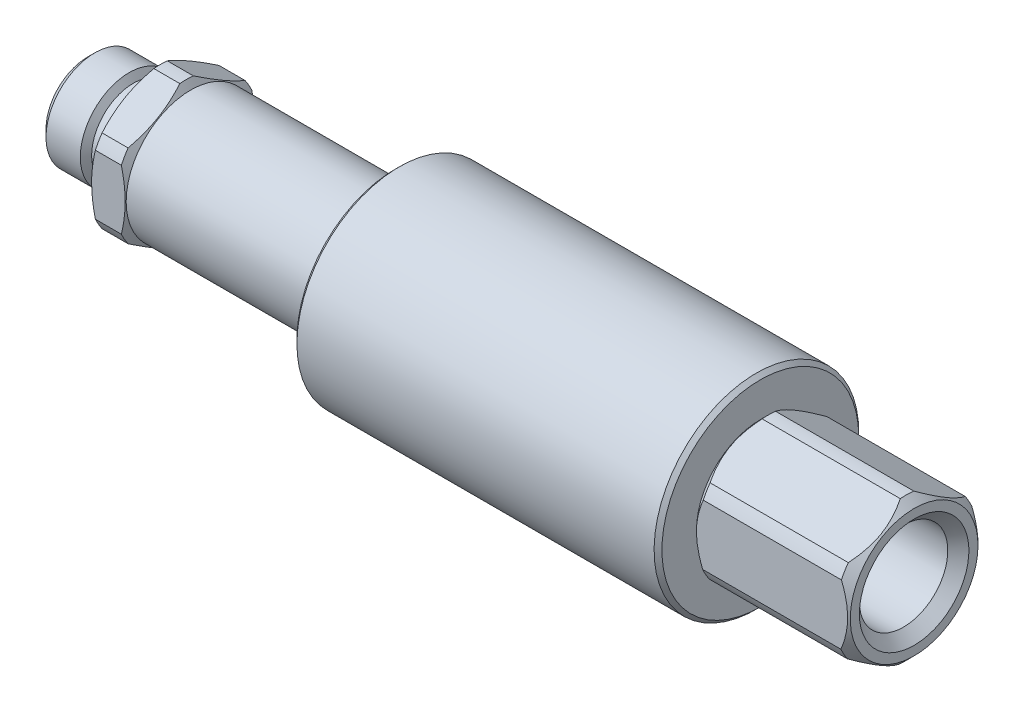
ISO-10303-21;
HEADER;
FILE_DESCRIPTION(('STEP AP214'),'2;1');
FILE_NAME('part.step','',(''),(''),'','','');
FILE_SCHEMA(('AUTOMOTIVE_DESIGN { 1 0 10303 214 1 1 1 1 }'));
ENDSEC;
DATA;
#1=APPLICATION_CONTEXT('core data for automotive mechanical design processes');
#2=APPLICATION_PROTOCOL_DEFINITION('international standard','automotive_design',2000,#1);
#3=PRODUCT_CONTEXT('',#1,'mechanical');
#4=PRODUCT('Part','Part','',(#3));
#5=PRODUCT_RELATED_PRODUCT_CATEGORY('part','',(#4));
#6=PRODUCT_DEFINITION_FORMATION('','',#4);
#7=PRODUCT_DEFINITION_CONTEXT('part definition',#1,'design');
#8=PRODUCT_DEFINITION('design','',#6,#7);
#9=PRODUCT_DEFINITION_SHAPE('','',#8);
#10=(LENGTH_UNIT() NAMED_UNIT(*) SI_UNIT(.MILLI.,.METRE.));
#11=(NAMED_UNIT(*) PLANE_ANGLE_UNIT() SI_UNIT($,.RADIAN.));
#12=(NAMED_UNIT(*) SI_UNIT($,.STERADIAN.) SOLID_ANGLE_UNIT());
#13=UNCERTAINTY_MEASURE_WITH_UNIT(LENGTH_MEASURE(1.E-05),#10,'distance_accuracy_value','');
#14=(GEOMETRIC_REPRESENTATION_CONTEXT(3) GLOBAL_UNCERTAINTY_ASSIGNED_CONTEXT((#13)) GLOBAL_UNIT_ASSIGNED_CONTEXT((#10,
#11,#12)) REPRESENTATION_CONTEXT('',''));
#15=CARTESIAN_POINT('',(0.,0.,0.));
#16=DIRECTION('',(0.,0.,1.));
#17=DIRECTION('',(1.,0.,0.));
#18=AXIS2_PLACEMENT_3D('',#15,#16,#17);
#19=CARTESIAN_POINT('',(27.089206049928,8.67692980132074,-1.35348559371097));
#20=DIRECTION('',(-1.,0.,0.));
#21=DIRECTION('',(0.,0.,1.));
#22=AXIS2_PLACEMENT_3D('',#19,#20,#21);
#23=PLANE('',#22);
#24=CARTESIAN_POINT('',(27.089206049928,3.78742980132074,-1.35348559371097));
#25=DIRECTION('',(1.,0.,0.));
#26=DIRECTION('',(0.,-0.740634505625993,-0.671908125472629));
#27=AXIS2_PLACEMENT_3D('',#24,#25,#26);
#28=CIRCLE('',#27,9.5885);
#29=CARTESIAN_POINT('',(27.089206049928,-3.31414415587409,-7.79607665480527));
#30=VERTEX_POINT('',#29);
#31=EDGE_CURVE('E269',#30,#30,#28,.T.);
#32=ORIENTED_EDGE('',*,*,#31,.T.);
#33=EDGE_LOOP('',(#32));
#34=FACE_BOUND('',#33,.T.);
#35=CARTESIAN_POINT('',(27.089206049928,3.78742980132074,-1.35348559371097));
#36=DIRECTION('',(-1.,0.,0.));
#37=DIRECTION('',(0.,0.,1.));
#38=AXIS2_PLACEMENT_3D('',#35,#36,#37);
#39=CIRCLE('',#38,6.223);
#40=CARTESIAN_POINT('',(27.089206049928,3.78742980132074,4.86951440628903));
#41=VERTEX_POINT('',#40);
#42=EDGE_CURVE('E10',#41,#41,#39,.F.);
#43=ORIENTED_EDGE('',*,*,#42,.F.);
#44=EDGE_LOOP('',(#43));
#45=FACE_BOUND('',#44,.T.);
#46=ADVANCED_FACE('F17',(#34,#45),#23,.F.);
#47=CARTESIAN_POINT('',(-38.442793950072,3.78742980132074,-1.35348559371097));
#48=DIRECTION('',(-1.,0.,0.));
#49=DIRECTION('',(0.,0.,1.));
#50=AXIS2_PLACEMENT_3D('',#47,#48,#49);
#51=CYLINDRICAL_SURFACE('',#50,6.28649999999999);
#52=CARTESIAN_POINT('',(-28.409793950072,3.78742980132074,-1.35348559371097));
#53=DIRECTION('',(-1.,0.,0.));
#54=DIRECTION('',(0.,0.,1.));
#55=AXIS2_PLACEMENT_3D('',#52,#53,#54);
#56=CIRCLE('',#55,6.28649999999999);
#57=CARTESIAN_POINT('',(-28.409793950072,3.78742980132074,4.93301440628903));
#58=VERTEX_POINT('',#57);
#59=EDGE_CURVE('E732',#58,#58,#56,.T.);
#60=ORIENTED_EDGE('',*,*,#59,.F.);
#61=EDGE_LOOP('',(#60));
#62=FACE_BOUND('',#61,.T.);
#63=CARTESIAN_POINT('',(-8.470793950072,3.78742980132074,-1.35348559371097));
#64=DIRECTION('',(1.,0.,0.));
#65=DIRECTION('',(0.,0.,-1.));
#66=AXIS2_PLACEMENT_3D('',#63,#64,#65);
#67=CIRCLE('',#66,6.28649999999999);
#68=CARTESIAN_POINT('',(-8.470793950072,3.78742980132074,-7.63998559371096));
#69=VERTEX_POINT('',#68);
#70=EDGE_CURVE('E26',#69,#69,#67,.T.);
#71=ORIENTED_EDGE('',*,*,#70,.F.);
#72=EDGE_LOOP('',(#71));
#73=FACE_BOUND('',#72,.T.);
#74=ADVANCED_FACE('F521',(#62,#73),#51,.T.);
#75=CARTESIAN_POINT('',(-31.3451765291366,3.78742980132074,-1.35348559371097));
#76=DIRECTION('',(1.,0.,0.));
#77=DIRECTION('',(0.,0.,-1.));
#78=AXIS2_PLACEMENT_3D('',#75,#76,#77);
#79=CONICAL_SURFACE('',#78,6.98499999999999,1.0471975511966);
#80=CARTESIAN_POINT('',(-31.3451765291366,3.78742980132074,-1.35348559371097));
#81=DIRECTION('',(-1.,0.,0.));
#82=DIRECTION('',(0.,0.,1.));
#83=AXIS2_PLACEMENT_3D('',#80,#81,#82);
#84=CIRCLE('',#83,6.98499999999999);
#85=CARTESIAN_POINT('',(-31.3451765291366,0.877494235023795,-7.70348559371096));
#86=VERTEX_POINT('',#85);
#87=CARTESIAN_POINT('',(-31.3451765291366,-0.256863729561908,-7.04856371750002));
#88=VERTEX_POINT('',#87);
#89=EDGE_CURVE('E747',#86,#88,#84,.T.);
#90=ORIENTED_EDGE('',*,*,#89,.T.);
#91=CARTESIAN_POINT('',(-31.3449765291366,-0.256448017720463,-7.04928375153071));
#92=CARTESIAN_POINT('',(-31.3823535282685,-0.334121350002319,-6.91474959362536));
#93=CARTESIAN_POINT('',(-31.4173912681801,-0.412085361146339,-6.77971196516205));
#94=CARTESIAN_POINT('',(-31.4822724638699,-0.568574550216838,-6.50866473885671));
#95=CARTESIAN_POINT('',(-31.5121143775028,-0.647099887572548,-6.37265486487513));
#96=CARTESIAN_POINT('',(-31.5660962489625,-0.804735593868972,-6.09962181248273));
#97=CARTESIAN_POINT('',(-31.5902296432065,-0.88384652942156,-5.96259765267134));
#98=CARTESIAN_POINT('',(-31.6322674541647,-1.04247556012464,-5.68784411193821));
#99=CARTESIAN_POINT('',(-31.6501724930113,-1.12199361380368,-5.55011480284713));
#100=CARTESIAN_POINT('',(-31.6790773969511,-1.27978102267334,-5.27681899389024));
#101=CARTESIAN_POINT('',(-31.6902051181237,-1.35804448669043,-5.14126269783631));
#102=CARTESIAN_POINT('',(-31.7058424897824,-1.51473617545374,-4.86986473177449));
#103=CARTESIAN_POINT('',(-31.7103522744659,-1.59316439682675,-4.73402306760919));
#104=CARTESIAN_POINT('',(-31.7126462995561,-1.74998787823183,-4.46239682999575));
#105=CARTESIAN_POINT('',(-31.7104354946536,-1.82838311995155,-4.32661228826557));
#106=CARTESIAN_POINT('',(-31.6993526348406,-1.98504895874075,-4.05525909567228));
#107=CARTESIAN_POINT('',(-31.6904810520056,-2.06331956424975,-3.91969043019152));
#108=CARTESIAN_POINT('',(-31.6650705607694,-2.22742482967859,-3.63545177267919));
#109=CARTESIAN_POINT('',(-31.6478536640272,-2.31323322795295,-3.4868272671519));
#110=CARTESIAN_POINT('',(-31.6060555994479,-2.48440485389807,-3.19034931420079));
#111=CARTESIAN_POINT('',(-31.5814737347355,-2.56976803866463,-3.04249594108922));
#112=CARTESIAN_POINT('',(-31.5252186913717,-2.74087667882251,-2.74612708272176));
#113=CARTESIAN_POINT('',(-31.4934697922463,-2.82661585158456,-2.59762247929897));
#114=CARTESIAN_POINT('',(-31.4237327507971,-2.99742431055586,-2.30177354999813));
#115=CARTESIAN_POINT('',(-31.385747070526,-3.08249384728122,-2.15442879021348));
#116=CARTESIAN_POINT('',(-31.3449765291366,-3.16721500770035,-2.00768743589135));
#117=B_SPLINE_CURVE_WITH_KNOTS('',3,(#91,#92,#93,#94,#95,#96,#97,#98,#99,#100,#101,#102,#103,
#104,#105,#106,#107,#108,#109,#110,#111,#112,#113,#114,#115,#116),.UNSPECIFIED.,.F.,.F.,(4,2,2,
2,2,2,2,2,2,2,2,2,4),(0.,0.479348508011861,0.958839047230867,1.43887824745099,1.91886948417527,
2.38949984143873,2.86012065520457,3.33039459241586,3.80063520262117,4.31789760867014,
4.83520897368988,5.35826531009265,5.88111565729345),.UNSPECIFIED.);
#118=CARTESIAN_POINT('',(-31.711793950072,-1.71183151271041,-4.52848559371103));
#119=VERTEX_POINT('',#118);
#120=EDGE_CURVE('E953',#88,#119,#117,.T.);
#121=ORIENTED_EDGE('',*,*,#120,.T.);
#122=CARTESIAN_POINT('',(-31.711793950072,3.78742980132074,-1.35348559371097));
#123=DIRECTION('',(-1.,0.,0.));
#124=DIRECTION('',(0.,0.,1.));
#125=AXIS2_PLACEMENT_3D('',#122,#123,#124);
#126=CIRCLE('',#125,6.34999999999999);
#127=CARTESIAN_POINT('',(-31.711793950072,3.78742980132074,-7.70348559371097));
#128=VERTEX_POINT('',#127);
#129=EDGE_CURVE('E752',#128,#119,#126,.T.);
#130=ORIENTED_EDGE('',*,*,#129,.F.);
#131=CARTESIAN_POINT('',(-28.7612864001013,-5.7529544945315,-7.70348559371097));
#132=CARTESIAN_POINT('',(-28.8945841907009,-5.47552644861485,-7.70348559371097));
#133=CARTESIAN_POINT('',(-29.0264996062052,-5.19742137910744,-7.70348559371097));
#134=CARTESIAN_POINT('',(-29.2867712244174,-4.63949013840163,-7.70348559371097));
#135=CARTESIAN_POINT('',(-29.4151267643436,-4.35966365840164,-7.70348559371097));
#136=CARTESIAN_POINT('',(-29.6682008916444,-3.79631839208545,-7.70348559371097));
#137=CARTESIAN_POINT('',(-29.7928926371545,-3.51278750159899,-7.70348559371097));
#138=CARTESIAN_POINT('',(-30.0366501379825,-2.94332676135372,-7.70348559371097));
#139=CARTESIAN_POINT('',(-30.1557162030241,-2.65739704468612,-7.70348559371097));
#140=CARTESIAN_POINT('',(-30.3877808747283,-2.08000348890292,-7.70348559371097));
#141=CARTESIAN_POINT('',(-30.5007133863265,-1.78851293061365,-7.70348559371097));
#142=CARTESIAN_POINT('',(-30.7172683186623,-1.20203018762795,-7.70348559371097));
#143=CARTESIAN_POINT('',(-30.8208896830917,-0.907037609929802,-7.70348559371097));
#144=CARTESIAN_POINT('',(-31.0159030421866,-0.313747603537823,-7.70348559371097));
#145=CARTESIAN_POINT('',(-31.1073227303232,-0.0154593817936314,-7.70348559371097));
#146=CARTESIAN_POINT('',(-31.2748484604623,0.585333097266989,-7.70348559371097));
#147=CARTESIAN_POINT('',(-31.3509595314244,0.887835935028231,-7.70348559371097));
#148=CARTESIAN_POINT('',(-31.484068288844,1.49738263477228,-7.70348559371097));
#149=CARTESIAN_POINT('',(-31.541051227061,1.80442981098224,-7.70348559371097));
#150=CARTESIAN_POINT('',(-31.6092276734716,2.26754157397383,-7.70348559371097));
#151=CARTESIAN_POINT('',(-31.6290716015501,2.42235573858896,-7.70348559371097));
#152=CARTESIAN_POINT('',(-31.6626004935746,2.73264411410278,-7.70348559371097));
#153=CARTESIAN_POINT('',(-31.6762860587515,2.888118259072,-7.70348559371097));
#154=CARTESIAN_POINT('',(-31.6971382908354,3.19863864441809,-7.70348559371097));
#155=CARTESIAN_POINT('',(-31.7043406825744,3.35368247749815,-7.70348559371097));
#156=CARTESIAN_POINT('',(-31.7121924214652,3.66393512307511,-7.70348559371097));
#157=CARTESIAN_POINT('',(-31.7128418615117,3.81914393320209,-7.70348559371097));
#158=CARTESIAN_POINT('',(-31.707572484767,4.12941050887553,-7.70348559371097));
#159=CARTESIAN_POINT('',(-31.7016553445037,4.2844683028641,-7.70348559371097));
#160=CARTESIAN_POINT('',(-31.6833937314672,4.5942073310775,-7.70348559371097));
#161=CARTESIAN_POINT('',(-31.6710488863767,4.74888854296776,-7.70348559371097));
#162=CARTESIAN_POINT('',(-31.6329897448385,5.12973943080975,-7.70348559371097));
#163=CARTESIAN_POINT('',(-31.603724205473,5.35556058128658,-7.70348559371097));
#164=CARTESIAN_POINT('',(-31.5331688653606,5.80530795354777,-7.70348559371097));
#165=CARTESIAN_POINT('',(-31.4918771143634,6.02923386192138,-7.70348559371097));
#166=CARTESIAN_POINT('',(-31.352048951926,6.69862284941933,-7.70348559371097));
#167=CARTESIAN_POINT('',(-31.2376596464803,7.14080612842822,-7.70348559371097));
#168=CARTESIAN_POINT('',(-31.0420185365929,7.80186558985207,-7.70348559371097));
#169=CARTESIAN_POINT('',(-30.9719045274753,8.02423245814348,-7.70348559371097));
#170=CARTESIAN_POINT('',(-30.8250795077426,8.46681904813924,-7.70348559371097));
#171=CARTESIAN_POINT('',(-30.7483679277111,8.6870385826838,-7.70348559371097));
#172=CARTESIAN_POINT('',(-30.5899609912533,9.12422603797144,-7.70348559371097));
#173=CARTESIAN_POINT('',(-30.5082968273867,9.34120537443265,-7.70348559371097));
#174=CARTESIAN_POINT('',(-30.3404952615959,9.77334748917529,-7.70348559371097));
#175=CARTESIAN_POINT('',(-30.2543593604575,9.98851084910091,-7.70348559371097));
#176=CARTESIAN_POINT('',(-30.1664123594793,10.2029143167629,-7.70348559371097));
#177=B_SPLINE_CURVE_WITH_KNOTS('',3,(#131,#132,#133,#134,#135,#136,#137,#138,#139,#140,#141,
#142,#143,#144,#145,#146,#147,#148,#149,#150,#151,#152,#153,#154,#155,#156,#157,#158,#159,#160,
#161,#162,#163,#164,#165,#166,#167,#168,#169,#170,#171,#172,#173,#174,#175,#176),.UNSPECIFIED.,
.F.,.F.,(4,2,2,2,2,2,2,2,2,2,2,2,2,2,2,2,2,2,2,2,2,2,4),(0.,0.923383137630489,1.84693705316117,
2.77610339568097,3.7052185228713,4.64290363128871,5.58069498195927,6.5163203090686,
7.45163777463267,8.38767474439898,8.85581367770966,9.32390689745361,9.78940466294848,
10.2548958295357,10.720268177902,11.1856674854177,11.8684042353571,12.5512517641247,
13.9196249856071,14.6190523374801,15.3185401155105,16.0140058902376,16.7092397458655),.UNSPECIFIED.);
#178=EDGE_CURVE('E620',#128,#86,#177,.F.);
#179=ORIENTED_EDGE('',*,*,#178,.T.);
#180=EDGE_LOOP('',(#90,#121,#130,#179));
#181=FACE_BOUND('',#180,.T.);
#182=ADVANCED_FACE('F526',(#181),#79,.T.);
#183=CARTESIAN_POINT('',(-38.442793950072,3.78742980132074,-1.35348559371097));
#184=DIRECTION('',(-1.,0.,0.));
#185=DIRECTION('',(0.,0.,1.));
#186=AXIS2_PLACEMENT_3D('',#183,#184,#185);
#187=CYLINDRICAL_SURFACE('',#186,6.98499999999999);
#188=CARTESIAN_POINT('',(-28.813073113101,3.78742980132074,-1.35348559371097));
#189=DIRECTION('',(-1.,0.,0.));
#190=DIRECTION('',(0.,0.,1.));
#191=AXIS2_PLACEMENT_3D('',#188,#189,#190);
#192=CIRCLE('',#191,6.98499999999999);
#193=CARTESIAN_POINT('',(-28.813073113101,0.877494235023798,-7.70348559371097));
#194=VERTEX_POINT('',#193);
#195=CARTESIAN_POINT('',(-28.813073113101,-0.25686372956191,-7.04856371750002));
#196=VERTEX_POINT('',#195);
#197=EDGE_CURVE('E744',#194,#196,#192,.T.);
#198=ORIENTED_EDGE('',*,*,#197,.T.);
#199=DIRECTION('',(-1.,0.,0.));
#200=VECTOR('',#199,1.);
#201=CARTESIAN_POINT('',(-38.442793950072,-0.256863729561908,-7.04856371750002));
#202=LINE('',#201,#200);
#203=EDGE_CURVE('E38',#196,#88,#202,.T.);
#204=ORIENTED_EDGE('',*,*,#203,.T.);
#205=ORIENTED_EDGE('',*,*,#89,.F.);
#206=DIRECTION('',(-1.,0.,0.));
#207=VECTOR('',#206,1.);
#208=CARTESIAN_POINT('',(-38.442793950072,0.877494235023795,-7.70348559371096));
#209=LINE('',#208,#207);
#210=EDGE_CURVE('E706',#86,#194,#209,.F.);
#211=ORIENTED_EDGE('',*,*,#210,.T.);
#212=EDGE_LOOP('',(#198,#204,#205,#211));
#213=FACE_BOUND('',#212,.T.);
#214=ADVANCED_FACE('F1264',(#213),#187,.T.);
#215=CARTESIAN_POINT('',(-31.711793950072,-1.71183151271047,1.82151440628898));
#216=VERTEX_POINT('',#215);
#217=EDGE_CURVE('E756',#119,#216,#126,.T.);
#218=ORIENTED_EDGE('',*,*,#217,.F.);
#219=CARTESIAN_POINT('',(-31.3451765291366,-3.16679929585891,-2.00840746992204));
#220=VERTEX_POINT('',#219);
#221=EDGE_CURVE('E957',#119,#220,#117,.T.);
#222=ORIENTED_EDGE('',*,*,#221,.T.);
#223=CARTESIAN_POINT('',(-31.3451765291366,-3.16679929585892,-0.698563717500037));
#224=VERTEX_POINT('',#223);
#225=EDGE_CURVE('E751',#220,#224,#84,.T.);
#226=ORIENTED_EDGE('',*,*,#225,.T.);
#227=CARTESIAN_POINT('',(-31.3449765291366,-3.16721500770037,-0.699283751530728));
#228=CARTESIAN_POINT('',(-31.3823535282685,-3.08954167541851,-0.564749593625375));
#229=CARTESIAN_POINT('',(-31.4173912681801,-3.01157766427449,-0.429711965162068));
#230=CARTESIAN_POINT('',(-31.4822724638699,-2.855088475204,-0.158664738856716));
#231=CARTESIAN_POINT('',(-31.5121143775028,-2.77656313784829,-0.0226548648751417));
#232=CARTESIAN_POINT('',(-31.5660962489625,-2.61892743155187,0.250378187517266));
#233=CARTESIAN_POINT('',(-31.5902296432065,-2.53981649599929,0.387402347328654));
#234=CARTESIAN_POINT('',(-31.6322674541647,-2.38118746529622,0.662155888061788));
#235=CARTESIAN_POINT('',(-31.6501724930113,-2.30166941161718,0.799885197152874));
#236=CARTESIAN_POINT('',(-31.6790773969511,-2.14388200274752,1.07318100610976));
#237=CARTESIAN_POINT('',(-31.6902051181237,-2.06561853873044,1.20873730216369));
#238=CARTESIAN_POINT('',(-31.7058424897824,-1.90892684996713,1.48013526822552));
#239=CARTESIAN_POINT('',(-31.7103522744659,-1.83049862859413,1.61597693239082));
#240=CARTESIAN_POINT('',(-31.7126462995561,-1.67367514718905,1.88760317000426));
#241=CARTESIAN_POINT('',(-31.7104354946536,-1.59527990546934,2.02338771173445));
#242=CARTESIAN_POINT('',(-31.6993526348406,-1.43861406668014,2.29474090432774));
#243=CARTESIAN_POINT('',(-31.6904810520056,-1.36034346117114,2.4303095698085));
#244=CARTESIAN_POINT('',(-31.6650705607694,-1.1962381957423,2.71454822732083));
#245=CARTESIAN_POINT('',(-31.6478536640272,-1.11042979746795,2.86317273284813));
#246=CARTESIAN_POINT('',(-31.6060555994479,-0.939258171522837,3.15965068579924));
#247=CARTESIAN_POINT('',(-31.5814737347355,-0.85389498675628,3.30750405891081));
#248=CARTESIAN_POINT('',(-31.5252186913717,-0.682786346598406,3.60387291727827));
#249=CARTESIAN_POINT('',(-31.4934697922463,-0.597047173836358,3.75237752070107));
#250=CARTESIAN_POINT('',(-31.4237327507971,-0.426238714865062,4.04822645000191));
#251=CARTESIAN_POINT('',(-31.385747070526,-0.341169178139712,4.19557120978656));
#252=CARTESIAN_POINT('',(-31.3449765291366,-0.25644801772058,4.3423125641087));
#253=B_SPLINE_CURVE_WITH_KNOTS('',3,(#227,#228,#229,#230,#231,#232,#233,#234,#235,#236,#237,
#238,#239,#240,#241,#242,#243,#244,#245,#246,#247,#248,#249,#250,#251,#252),.UNSPECIFIED.,.F.,
.F.,(4,2,2,2,2,2,2,2,2,2,2,2,4),(0.,0.479348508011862,0.958839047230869,1.43887824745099,
1.91886948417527,2.38949984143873,2.86012065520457,3.33039459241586,3.80063520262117,
4.31789760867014,4.83520897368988,5.35826531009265,5.88111565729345),.UNSPECIFIED.);
#254=EDGE_CURVE('E604',#224,#216,#253,.T.);
#255=ORIENTED_EDGE('',*,*,#254,.T.);
#256=EDGE_LOOP('',(#218,#222,#226,#255));
#257=FACE_BOUND('',#256,.T.);
#258=ADVANCED_FACE('F815',(#257),#79,.T.);
#259=ORIENTED_EDGE('',*,*,#225,.F.);
#260=DIRECTION('',(-1.,0.,0.));
#261=VECTOR('',#260,1.);
#262=CARTESIAN_POINT('',(-38.442793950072,-3.16679929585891,-2.00840746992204));
#263=LINE('',#262,#261);
#264=CARTESIAN_POINT('',(-28.813073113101,-3.16679929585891,-2.00840746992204));
#265=VERTEX_POINT('',#264);
#266=EDGE_CURVE('E966',#220,#265,#263,.F.);
#267=ORIENTED_EDGE('',*,*,#266,.T.);
#268=CARTESIAN_POINT('',(-28.813073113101,-3.16679929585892,-0.698563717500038));
#269=VERTEX_POINT('',#268);
#270=EDGE_CURVE('E48',#265,#269,#192,.T.);
#271=ORIENTED_EDGE('',*,*,#270,.T.);
#272=DIRECTION('',(-1.,0.,0.));
#273=VECTOR('',#272,1.);
#274=CARTESIAN_POINT('',(-38.442793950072,-3.16679929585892,-0.698563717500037));
#275=LINE('',#274,#273);
#276=EDGE_CURVE('E605',#269,#224,#275,.T.);
#277=ORIENTED_EDGE('',*,*,#276,.T.);
#278=EDGE_LOOP('',(#259,#267,#271,#277));
#279=FACE_BOUND('',#278,.T.);
#280=ADVANCED_FACE('F1363',(#279),#187,.T.);
#281=CARTESIAN_POINT('',(-31.711793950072,3.7874298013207,4.99651440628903));
#282=VERTEX_POINT('',#281);
#283=EDGE_CURVE('E821',#216,#282,#126,.T.);
#284=ORIENTED_EDGE('',*,*,#283,.F.);
#285=CARTESIAN_POINT('',(-31.3451765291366,-0.256863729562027,4.341592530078));
#286=VERTEX_POINT('',#285);
#287=EDGE_CURVE('E596',#216,#286,#253,.T.);
#288=ORIENTED_EDGE('',*,*,#287,.T.);
#289=CARTESIAN_POINT('',(-31.3451765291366,0.877494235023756,4.99651440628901));
#290=VERTEX_POINT('',#289);
#291=EDGE_CURVE('E1463',#286,#290,#84,.T.);
#292=ORIENTED_EDGE('',*,*,#291,.T.);
#293=CARTESIAN_POINT('',(-29.1256541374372,-4.98478724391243,4.99651440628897));
#294=CARTESIAN_POINT('',(-29.2469708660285,-4.72530325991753,4.99651440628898));
#295=CARTESIAN_POINT('',(-29.3668344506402,-4.46512564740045,4.99651440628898));
#296=CARTESIAN_POINT('',(-29.6028552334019,-3.94303165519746,4.99651440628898));
#297=CARTESIAN_POINT('',(-29.7190116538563,-3.68111492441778,4.99651440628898));
#298=CARTESIAN_POINT('',(-29.947459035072,-3.15370083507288,4.99651440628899));
#299=CARTESIAN_POINT('',(-30.0597222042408,-2.88819138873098,4.99651440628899));
#300=CARTESIAN_POINT('',(-30.2784782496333,-2.35481395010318,4.99651440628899));
#301=CARTESIAN_POINT('',(-30.384971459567,-2.08694609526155,4.99651440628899));
#302=CARTESIAN_POINT('',(-30.5908958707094,-1.54797790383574,4.996514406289));
#303=CARTESIAN_POINT('',(-30.6903149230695,-1.27687289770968,4.996514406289));
#304=CARTESIAN_POINT('',(-30.8800001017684,-0.731425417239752,4.996514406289));
#305=CARTESIAN_POINT('',(-30.9702653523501,-0.457082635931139,4.996514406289));
#306=CARTESIAN_POINT('',(-31.1390443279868,0.0945335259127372,4.99651440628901));
#307=CARTESIAN_POINT('',(-31.2175849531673,0.371798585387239,4.99651440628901));
#308=CARTESIAN_POINT('',(-31.3603026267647,0.929988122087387,4.99651440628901));
#309=CARTESIAN_POINT('',(-31.4244826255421,1.21091183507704,4.99651440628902));
#310=CARTESIAN_POINT('',(-31.5389963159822,1.79476148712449,4.99651440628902));
#311=CARTESIAN_POINT('',(-31.5881491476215,2.09792428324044,4.99651440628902));
#312=CARTESIAN_POINT('',(-31.6630908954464,2.70720634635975,4.99651440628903));
#313=CARTESIAN_POINT('',(-31.6888790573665,3.01332570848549,4.99651440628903));
#314=CARTESIAN_POINT('',(-31.7148252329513,3.62561245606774,4.99651440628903));
#315=CARTESIAN_POINT('',(-31.715071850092,3.93177599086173,4.99651440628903));
#316=CARTESIAN_POINT('',(-31.6901311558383,4.54299510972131,4.99651440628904));
#317=CARTESIAN_POINT('',(-31.6649481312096,4.8480508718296,4.99651440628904));
#318=CARTESIAN_POINT('',(-31.5994518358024,5.38829848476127,4.99651440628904));
#319=CARTESIAN_POINT('',(-31.5636982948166,5.62406564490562,4.99651440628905));
#320=CARTESIAN_POINT('',(-31.4796708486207,6.09338702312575,4.99651440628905));
#321=CARTESIAN_POINT('',(-31.4313945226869,6.32694080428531,4.99651440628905));
#322=CARTESIAN_POINT('',(-31.323973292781,6.79204087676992,4.99651440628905));
#323=CARTESIAN_POINT('',(-31.2648049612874,7.02358169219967,4.99651440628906));
#324=CARTESIAN_POINT('',(-31.1373929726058,7.48415862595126,4.99651440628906));
#325=CARTESIAN_POINT('',(-31.0691483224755,7.71319446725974,4.99651440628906));
#326=CARTESIAN_POINT('',(-30.9238654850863,8.17288914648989,4.99651440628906));
#327=CARTESIAN_POINT('',(-30.8466934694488,8.4035053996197,4.99651440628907));
#328=CARTESIAN_POINT('',(-30.6859338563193,8.86249894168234,4.99651440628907));
#329=CARTESIAN_POINT('',(-30.6023457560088,9.09087605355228,4.99651440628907));
#330=CARTESIAN_POINT('',(-30.4304233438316,9.54427028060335,4.99651440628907));
#331=CARTESIAN_POINT('',(-30.3421202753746,9.76929930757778,4.99651440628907));
#332=CARTESIAN_POINT('',(-30.1612163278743,10.2175465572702,4.99651440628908));
#333=CARTESIAN_POINT('',(-30.0686167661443,10.4407653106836,4.99651440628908));
#334=CARTESIAN_POINT('',(-29.9742914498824,10.6632327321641,4.99651440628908));
#335=B_SPLINE_CURVE_WITH_KNOTS('',3,(#293,#294,#295,#296,#297,#298,#299,#300,#301,#302,#303,
#304,#305,#306,#307,#308,#309,#310,#311,#312,#313,#314,#315,#316,#317,#318,#319,#320,#321,#322,
#323,#324,#325,#326,#327,#328,#329,#330,#331,#332,#333,#334),.UNSPECIFIED.,.F.,.F.,(4,2,2,2,2,2,
2,2,2,2,2,2,2,2,2,2,2,2,2,2,4),(0.,0.859344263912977,1.71886763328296,2.58361620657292,
3.44831471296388,4.31446406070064,5.18069619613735,6.04490931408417,6.90894471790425,
7.82951924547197,8.75012349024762,9.66753405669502,10.5847899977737,11.2998222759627,
12.0149928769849,12.7317200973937,13.4485257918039,14.1779698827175,14.9074711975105,
15.6326263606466,16.3575606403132),.UNSPECIFIED.);
#336=EDGE_CURVE('E652',#290,#282,#335,.T.);
#337=ORIENTED_EDGE('',*,*,#336,.T.);
#338=EDGE_LOOP('',(#284,#288,#292,#337));
#339=FACE_BOUND('',#338,.T.);
#340=ADVANCED_FACE('F822',(#339),#79,.T.);
#341=ORIENTED_EDGE('',*,*,#291,.F.);
#342=DIRECTION('',(-1.,0.,0.));
#343=VECTOR('',#342,1.);
#344=CARTESIAN_POINT('',(-38.442793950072,-0.256863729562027,4.341592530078));
#345=LINE('',#344,#343);
#346=CARTESIAN_POINT('',(-28.813073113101,-0.256863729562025,4.341592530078));
#347=VERTEX_POINT('',#346);
#348=EDGE_CURVE('E956',#286,#347,#345,.F.);
#349=ORIENTED_EDGE('',*,*,#348,.T.);
#350=CARTESIAN_POINT('',(-28.813073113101,0.877494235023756,4.99651440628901));
#351=VERTEX_POINT('',#350);
#352=EDGE_CURVE('E793',#347,#351,#192,.T.);
#353=ORIENTED_EDGE('',*,*,#352,.T.);
#354=DIRECTION('',(-1.,0.,0.));
#355=VECTOR('',#354,1.);
#356=CARTESIAN_POINT('',(-38.442793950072,0.877494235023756,4.99651440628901));
#357=LINE('',#356,#355);
#358=EDGE_CURVE('E653',#351,#290,#357,.T.);
#359=ORIENTED_EDGE('',*,*,#358,.T.);
#360=EDGE_LOOP('',(#341,#349,#353,#359));
#361=FACE_BOUND('',#360,.T.);
#362=ADVANCED_FACE('F1348',(#361),#187,.T.);
#363=CARTESIAN_POINT('',(-31.711793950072,9.28669111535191,1.82151440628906));
#364=VERTEX_POINT('',#363);
#365=EDGE_CURVE('E825',#282,#364,#126,.T.);
#366=ORIENTED_EDGE('',*,*,#365,.F.);
#367=CARTESIAN_POINT('',(-31.3451765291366,6.69736536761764,4.99651440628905));
#368=VERTEX_POINT('',#367);
#369=EDGE_CURVE('E645',#282,#368,#335,.T.);
#370=ORIENTED_EDGE('',*,*,#369,.T.);
#371=CARTESIAN_POINT('',(-31.3451765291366,7.83172333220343,4.34159253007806));
#372=VERTEX_POINT('',#371);
#373=EDGE_CURVE('E802',#368,#372,#84,.T.);
#374=ORIENTED_EDGE('',*,*,#373,.T.);
#375=CARTESIAN_POINT('',(-31.3449765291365,7.83130762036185,4.34231256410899));
#376=CARTESIAN_POINT('',(-31.3823535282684,7.90898095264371,4.20777840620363));
#377=CARTESIAN_POINT('',(-31.4173912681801,7.98694496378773,4.07274077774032));
#378=CARTESIAN_POINT('',(-31.4822724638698,8.14343415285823,3.80169355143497));
#379=CARTESIAN_POINT('',(-31.5121143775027,8.22195949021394,3.6656836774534));
#380=CARTESIAN_POINT('',(-31.5660962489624,8.37959519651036,3.39265062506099));
#381=CARTESIAN_POINT('',(-31.5902296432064,8.45870613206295,3.2556264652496));
#382=CARTESIAN_POINT('',(-31.6322674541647,8.61733516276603,2.98087292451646));
#383=CARTESIAN_POINT('',(-31.6501724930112,8.69685321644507,2.84314361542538));
#384=CARTESIAN_POINT('',(-31.6790773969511,8.85464062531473,2.56984780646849));
#385=CARTESIAN_POINT('',(-31.6902051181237,8.93290408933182,2.43429151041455));
#386=CARTESIAN_POINT('',(-31.7058424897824,9.08959577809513,2.16289354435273));
#387=CARTESIAN_POINT('',(-31.7103522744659,9.16802399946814,2.02705188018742));
#388=CARTESIAN_POINT('',(-31.7126462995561,9.32484748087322,1.75542564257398));
#389=CARTESIAN_POINT('',(-31.7104354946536,9.40324272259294,1.61964110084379));
#390=CARTESIAN_POINT('',(-31.6993526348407,9.55990856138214,1.3482879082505));
#391=CARTESIAN_POINT('',(-31.6904810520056,9.63817916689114,1.21271924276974));
#392=CARTESIAN_POINT('',(-31.6650705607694,9.80228443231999,0.928480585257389));
#393=CARTESIAN_POINT('',(-31.6478536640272,9.88809283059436,0.77985607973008));
#394=CARTESIAN_POINT('',(-31.6060555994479,10.0592644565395,0.483378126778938));
#395=CARTESIAN_POINT('',(-31.5814737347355,10.1446276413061,0.335524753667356));
#396=CARTESIAN_POINT('',(-31.5252186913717,10.315736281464,0.0391558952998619));
#397=CARTESIAN_POINT('',(-31.4934697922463,10.401475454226,-0.109348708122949));
#398=CARTESIAN_POINT('',(-31.4237327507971,10.5722839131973,-0.405197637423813));
#399=CARTESIAN_POINT('',(-31.385747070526,10.6573534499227,-0.552542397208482));
#400=CARTESIAN_POINT('',(-31.3449765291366,10.7420746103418,-0.699283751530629));
#401=B_SPLINE_CURVE_WITH_KNOTS('',3,(#375,#376,#377,#378,#379,#380,#381,#382,#383,#384,#385,
#386,#387,#388,#389,#390,#391,#392,#393,#394,#395,#396,#397,#398,#399,#400),.UNSPECIFIED.,.F.,
.F.,(4,2,2,2,2,2,2,2,2,2,2,2,4),(0.,0.479348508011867,0.958839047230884,1.43887824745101,
1.9188694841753,2.38949984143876,2.86012065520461,3.33039459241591,3.80063520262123,
4.31789760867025,4.83520897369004,5.35826531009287,5.88111565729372),.UNSPECIFIED.);
#402=EDGE_CURVE('E667',#372,#364,#401,.T.);
#403=ORIENTED_EDGE('',*,*,#402,.T.);
#404=EDGE_LOOP('',(#366,#370,#374,#403));
#405=FACE_BOUND('',#404,.T.);
#406=ADVANCED_FACE('F1340',(#405),#79,.T.);
#407=ORIENTED_EDGE('',*,*,#373,.F.);
#408=DIRECTION('',(-1.,0.,0.));
#409=VECTOR('',#408,1.);
#410=CARTESIAN_POINT('',(-38.442793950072,6.69736536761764,4.99651440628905));
#411=LINE('',#410,#409);
#412=CARTESIAN_POINT('',(-28.813073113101,6.69736536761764,4.99651440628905));
#413=VERTEX_POINT('',#412);
#414=EDGE_CURVE('E607',#368,#413,#411,.F.);
#415=ORIENTED_EDGE('',*,*,#414,.T.);
#416=CARTESIAN_POINT('',(-28.813073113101,7.83172333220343,4.34159253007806));
#417=VERTEX_POINT('',#416);
#418=EDGE_CURVE('E794',#413,#417,#192,.T.);
#419=ORIENTED_EDGE('',*,*,#418,.T.);
#420=DIRECTION('',(-1.,0.,0.));
#421=VECTOR('',#420,1.);
#422=CARTESIAN_POINT('',(-38.442793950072,7.83172333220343,4.34159253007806));
#423=LINE('',#422,#421);
#424=EDGE_CURVE('E656',#417,#372,#423,.T.);
#425=ORIENTED_EDGE('',*,*,#424,.T.);
#426=EDGE_LOOP('',(#407,#415,#419,#425));
#427=FACE_BOUND('',#426,.T.);
#428=ADVANCED_FACE('F801',(#427),#187,.T.);
#429=CARTESIAN_POINT('',(-31.711793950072,9.28669111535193,-4.52848559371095));
#430=VERTEX_POINT('',#429);
#431=EDGE_CURVE('E828',#364,#430,#126,.T.);
#432=ORIENTED_EDGE('',*,*,#431,.F.);
#433=CARTESIAN_POINT('',(-31.3451765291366,10.7416588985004,-0.698563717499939));
#434=VERTEX_POINT('',#433);
#435=EDGE_CURVE('E638',#364,#434,#401,.T.);
#436=ORIENTED_EDGE('',*,*,#435,.T.);
#437=CARTESIAN_POINT('',(-31.3451765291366,10.7416588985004,-2.00840746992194));
#438=VERTEX_POINT('',#437);
#439=EDGE_CURVE('E850',#434,#438,#84,.T.);
#440=ORIENTED_EDGE('',*,*,#439,.T.);
#441=CARTESIAN_POINT('',(-31.3449765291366,10.7420746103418,-2.00768743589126));
#442=CARTESIAN_POINT('',(-31.3823535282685,10.66440127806,-2.14222159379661));
#443=CARTESIAN_POINT('',(-31.4173912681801,10.586437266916,-2.27725922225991));
#444=CARTESIAN_POINT('',(-31.4822724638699,10.4299480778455,-2.54830644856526));
#445=CARTESIAN_POINT('',(-31.5121143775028,10.3514227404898,-2.68431632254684));
#446=CARTESIAN_POINT('',(-31.5660962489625,10.1937870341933,-2.95734937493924));
#447=CARTESIAN_POINT('',(-31.5902296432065,10.1146760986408,-3.09437353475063));
#448=CARTESIAN_POINT('',(-31.6322674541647,9.95604706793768,-3.36912707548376));
#449=CARTESIAN_POINT('',(-31.6501724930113,9.87652901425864,-3.50685638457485));
#450=CARTESIAN_POINT('',(-31.6790773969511,9.71874160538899,-3.78015219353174));
#451=CARTESIAN_POINT('',(-31.6902051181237,9.6404781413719,-3.91570848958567));
#452=CARTESIAN_POINT('',(-31.7058424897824,9.4837864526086,-4.18710645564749));
#453=CARTESIAN_POINT('',(-31.7103522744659,9.40535823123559,-4.3229481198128));
#454=CARTESIAN_POINT('',(-31.7126462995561,9.24853474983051,-4.59457435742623));
#455=CARTESIAN_POINT('',(-31.7104354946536,9.17013950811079,-4.73035889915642));
#456=CARTESIAN_POINT('',(-31.6993526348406,9.01347366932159,-5.00171209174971));
#457=CARTESIAN_POINT('',(-31.6904810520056,8.9352030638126,-5.13728075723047));
#458=CARTESIAN_POINT('',(-31.6650705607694,8.77109779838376,-5.4215194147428));
#459=CARTESIAN_POINT('',(-31.6478536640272,8.6852894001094,-5.57014392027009));
#460=CARTESIAN_POINT('',(-31.6060555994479,8.51411777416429,-5.86662187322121));
#461=CARTESIAN_POINT('',(-31.5814737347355,8.42875458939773,-6.01447524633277));
#462=CARTESIAN_POINT('',(-31.5252186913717,8.25764594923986,-6.31084410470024));
#463=CARTESIAN_POINT('',(-31.4934697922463,8.1719067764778,-6.45934870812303));
#464=CARTESIAN_POINT('',(-31.4237327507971,8.00109831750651,-6.75519763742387));
#465=CARTESIAN_POINT('',(-31.385747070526,7.91602878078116,-6.90254239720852));
#466=CARTESIAN_POINT('',(-31.3449765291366,7.83130762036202,-7.04928375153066));
#467=B_SPLINE_CURVE_WITH_KNOTS('',3,(#441,#442,#443,#444,#445,#446,#447,#448,#449,#450,#451,
#452,#453,#454,#455,#456,#457,#458,#459,#460,#461,#462,#463,#464,#465,#466),.UNSPECIFIED.,.F.,
.F.,(4,2,2,2,2,2,2,2,2,2,2,2,4),(0.,0.479348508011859,0.958839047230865,1.43887824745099,
1.91886948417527,2.38949984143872,2.86012065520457,3.33039459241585,3.80063520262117,
4.31789760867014,4.83520897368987,5.35826531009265,5.88111565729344),.UNSPECIFIED.);
#468=EDGE_CURVE('E700',#438,#430,#467,.T.);
#469=ORIENTED_EDGE('',*,*,#468,.T.);
#470=EDGE_LOOP('',(#432,#436,#440,#469));
#471=FACE_BOUND('',#470,.T.);
#472=ADVANCED_FACE('F615',(#471),#79,.T.);
#473=ORIENTED_EDGE('',*,*,#439,.F.);
#474=DIRECTION('',(-1.,0.,0.));
#475=VECTOR('',#474,1.);
#476=CARTESIAN_POINT('',(-38.442793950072,10.7416588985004,-0.698563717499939));
#477=LINE('',#476,#475);
#478=CARTESIAN_POINT('',(-28.813073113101,10.7416588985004,-0.69856371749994));
#479=VERTEX_POINT('',#478);
#480=EDGE_CURVE('E654',#434,#479,#477,.F.);
#481=ORIENTED_EDGE('',*,*,#480,.T.);
#482=CARTESIAN_POINT('',(-28.813073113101,10.7416588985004,-2.00840746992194));
#483=VERTEX_POINT('',#482);
#484=EDGE_CURVE('E742',#479,#483,#192,.T.);
#485=ORIENTED_EDGE('',*,*,#484,.T.);
#486=DIRECTION('',(-1.,0.,0.));
#487=VECTOR('',#486,1.);
#488=CARTESIAN_POINT('',(-38.442793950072,10.7416588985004,-2.00840746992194));
#489=LINE('',#488,#487);
#490=EDGE_CURVE('E684',#483,#438,#489,.T.);
#491=ORIENTED_EDGE('',*,*,#490,.T.);
#492=EDGE_LOOP('',(#473,#481,#485,#491));
#493=FACE_BOUND('',#492,.T.);
#494=ADVANCED_FACE('F849',(#493),#187,.T.);
#495=CARTESIAN_POINT('',(-38.442793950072,3.78742980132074,-1.35348559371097));
#496=DIRECTION('',(1.,0.,0.));
#497=DIRECTION('',(0.,0.,-1.));
#498=AXIS2_PLACEMENT_3D('',#495,#496,#497);
#499=PLANE('',#498);
#500=CARTESIAN_POINT('',(-38.442793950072,3.78742980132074,-1.35348559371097));
#501=DIRECTION('',(1.,0.,0.));
#502=DIRECTION('',(0.,0.,-1.));
#503=AXIS2_PLACEMENT_3D('',#500,#501,#502);
#504=CIRCLE('',#503,2.7686);
#505=CARTESIAN_POINT('',(-38.442793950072,3.78742980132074,-4.12208559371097));
#506=VERTEX_POINT('',#505);
#507=EDGE_CURVE('E280',#506,#506,#504,.T.);
#508=ORIENTED_EDGE('',*,*,#507,.T.);
#509=EDGE_LOOP('',(#508));
#510=FACE_BOUND('',#509,.T.);
#511=CARTESIAN_POINT('',(-38.442793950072,3.78742980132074,-1.35348559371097));
#512=DIRECTION('',(-1.,0.,0.));
#513=DIRECTION('',(0.,0.,1.));
#514=AXIS2_PLACEMENT_3D('',#511,#512,#513);
#515=CIRCLE('',#514,4.064);
#516=CARTESIAN_POINT('',(-38.442793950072,3.78742980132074,2.71051440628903));
#517=VERTEX_POINT('',#516);
#518=EDGE_CURVE('E771',#517,#517,#515,.T.);
#519=ORIENTED_EDGE('',*,*,#518,.T.);
#520=EDGE_LOOP('',(#519));
#521=FACE_BOUND('',#520,.T.);
#522=ADVANCED_FACE('F19',(#510,#521),#499,.F.);
#523=CARTESIAN_POINT('',(-37.744293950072,3.78742980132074,-1.35348559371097));
#524=DIRECTION('',(1.,0.,0.));
#525=DIRECTION('',(0.,0.,-1.));
#526=AXIS2_PLACEMENT_3D('',#523,#524,#525);
#527=CONICAL_SURFACE('',#526,4.76249999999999,0.785398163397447);
#528=ORIENTED_EDGE('',*,*,#518,.F.);
#529=EDGE_LOOP('',(#528));
#530=FACE_BOUND('',#529,.T.);
#531=CARTESIAN_POINT('',(-37.744293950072,3.78742980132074,-1.35348559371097));
#532=DIRECTION('',(-1.,0.,0.));
#533=DIRECTION('',(0.,0.,1.));
#534=AXIS2_PLACEMENT_3D('',#531,#532,#533);
#535=CIRCLE('',#534,4.76249999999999);
#536=CARTESIAN_POINT('',(-37.744293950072,3.78742980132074,3.40901440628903));
#537=VERTEX_POINT('',#536);
#538=EDGE_CURVE('E768',#537,#537,#535,.T.);
#539=ORIENTED_EDGE('',*,*,#538,.T.);
#540=EDGE_LOOP('',(#539));
#541=FACE_BOUND('',#540,.T.);
#542=ADVANCED_FACE('F1306',(#530,#541),#527,.T.);
#543=CARTESIAN_POINT('',(-38.442793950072,3.78742980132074,-1.35348559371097));
#544=DIRECTION('',(-1.,0.,0.));
#545=DIRECTION('',(0.,0.,1.));
#546=AXIS2_PLACEMENT_3D('',#543,#544,#545);
#547=CYLINDRICAL_SURFACE('',#546,4.76249999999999);
#548=ORIENTED_EDGE('',*,*,#538,.F.);
#549=EDGE_LOOP('',(#548));
#550=FACE_BOUND('',#549,.T.);
#551=CARTESIAN_POINT('',(-34.401073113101,3.78742980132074,-1.35348559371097));
#552=DIRECTION('',(-1.,0.,0.));
#553=DIRECTION('',(0.,0.,1.));
#554=AXIS2_PLACEMENT_3D('',#551,#552,#553);
#555=CIRCLE('',#554,4.76249999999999);
#556=CARTESIAN_POINT('',(-34.401073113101,3.78742980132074,3.40901440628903));
#557=VERTEX_POINT('',#556);
#558=EDGE_CURVE('E764',#557,#557,#555,.T.);
#559=ORIENTED_EDGE('',*,*,#558,.T.);
#560=EDGE_LOOP('',(#559));
#561=FACE_BOUND('',#560,.T.);
#562=ADVANCED_FACE('F1296',(#550,#561),#547,.T.);
#563=CARTESIAN_POINT('',(-33.997793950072,3.78742980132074,-1.35348559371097));
#564=DIRECTION('',(-1.,0.,0.));
#565=DIRECTION('',(0.,0.,1.));
#566=AXIS2_PLACEMENT_3D('',#563,#564,#565);
#567=CONICAL_SURFACE('',#566,4.06399999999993,1.0471975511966);
#568=ORIENTED_EDGE('',*,*,#558,.F.);
#569=EDGE_LOOP('',(#568));
#570=FACE_BOUND('',#569,.T.);
#571=CARTESIAN_POINT('',(-33.997793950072,3.78742980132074,-1.35348559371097));
#572=DIRECTION('',(-1.,0.,0.));
#573=DIRECTION('',(0.,0.,1.));
#574=AXIS2_PLACEMENT_3D('',#571,#572,#573);
#575=CIRCLE('',#574,4.06399999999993);
#576=CARTESIAN_POINT('',(-33.997793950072,3.78742980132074,2.71051440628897));
#577=VERTEX_POINT('',#576);
#578=EDGE_CURVE('E760',#577,#577,#575,.T.);
#579=ORIENTED_EDGE('',*,*,#578,.T.);
#580=EDGE_LOOP('',(#579));
#581=FACE_BOUND('',#580,.T.);
#582=ADVANCED_FACE('F1287',(#570,#581),#567,.T.);
#583=CARTESIAN_POINT('',(-38.442793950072,3.78742980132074,-1.35348559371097));
#584=DIRECTION('',(-1.,0.,0.));
#585=DIRECTION('',(0.,0.,1.));
#586=AXIS2_PLACEMENT_3D('',#583,#584,#585);
#587=CYLINDRICAL_SURFACE('',#586,4.06399999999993);
#588=ORIENTED_EDGE('',*,*,#578,.F.);
#589=EDGE_LOOP('',(#588));
#590=FACE_BOUND('',#589,.T.);
#591=CARTESIAN_POINT('',(-31.711793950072,3.78742980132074,-1.35348559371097));
#592=DIRECTION('',(-1.,0.,0.));
#593=DIRECTION('',(0.,0.,1.));
#594=AXIS2_PLACEMENT_3D('',#591,#592,#593);
#595=CIRCLE('',#594,4.06399999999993);
#596=CARTESIAN_POINT('',(-31.711793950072,3.78742980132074,2.71051440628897));
#597=VERTEX_POINT('',#596);
#598=EDGE_CURVE('E755',#597,#597,#595,.T.);
#599=ORIENTED_EDGE('',*,*,#598,.T.);
#600=EDGE_LOOP('',(#599));
#601=FACE_BOUND('',#600,.T.);
#602=ADVANCED_FACE('F1278',(#590,#601),#587,.T.);
#603=CARTESIAN_POINT('',(-31.711793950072,7.85142980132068,-1.35348559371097));
#604=DIRECTION('',(1.,0.,0.));
#605=DIRECTION('',(0.,0.,-1.));
#606=AXIS2_PLACEMENT_3D('',#603,#604,#605);
#607=PLANE('',#606);
#608=ORIENTED_EDGE('',*,*,#598,.F.);
#609=EDGE_LOOP('',(#608));
#610=FACE_BOUND('',#609,.T.);
#611=ORIENTED_EDGE('',*,*,#129,.T.);
#612=ORIENTED_EDGE('',*,*,#217,.T.);
#613=ORIENTED_EDGE('',*,*,#283,.T.);
#614=ORIENTED_EDGE('',*,*,#365,.T.);
#615=ORIENTED_EDGE('',*,*,#431,.T.);
#616=EDGE_CURVE('E750',#430,#128,#126,.T.);
#617=ORIENTED_EDGE('',*,*,#616,.T.);
#618=EDGE_LOOP('',(#611,#612,#613,#614,#615,#617));
#619=FACE_BOUND('',#618,.T.);
#620=ADVANCED_FACE('F613',(#610,#619),#607,.F.);
#621=ORIENTED_EDGE('',*,*,#616,.F.);
#622=CARTESIAN_POINT('',(-31.3451765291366,7.83172333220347,-7.04856371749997));
#623=VERTEX_POINT('',#622);
#624=EDGE_CURVE('E630',#430,#623,#467,.T.);
#625=ORIENTED_EDGE('',*,*,#624,.T.);
#626=CARTESIAN_POINT('',(-31.3451765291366,6.69736536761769,-7.70348559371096));
#627=VERTEX_POINT('',#626);
#628=EDGE_CURVE('E746',#623,#627,#84,.T.);
#629=ORIENTED_EDGE('',*,*,#628,.T.);
#630=EDGE_CURVE('E724',#627,#128,#177,.F.);
#631=ORIENTED_EDGE('',*,*,#630,.T.);
#632=EDGE_LOOP('',(#621,#625,#629,#631));
#633=FACE_BOUND('',#632,.T.);
#634=ADVANCED_FACE('F609',(#633),#79,.T.);
#635=ORIENTED_EDGE('',*,*,#628,.F.);
#636=DIRECTION('',(-1.,0.,0.));
#637=VECTOR('',#636,1.);
#638=CARTESIAN_POINT('',(-38.442793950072,7.83172333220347,-7.04856371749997));
#639=LINE('',#638,#637);
#640=CARTESIAN_POINT('',(-28.813073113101,7.83172333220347,-7.04856371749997));
#641=VERTEX_POINT('',#640);
#642=EDGE_CURVE('E676',#623,#641,#639,.F.);
#643=ORIENTED_EDGE('',*,*,#642,.T.);
#644=CARTESIAN_POINT('',(-28.813073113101,6.69736536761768,-7.70348559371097));
#645=VERTEX_POINT('',#644);
#646=EDGE_CURVE('E737',#641,#645,#192,.T.);
#647=ORIENTED_EDGE('',*,*,#646,.T.);
#648=DIRECTION('',(-1.,0.,0.));
#649=VECTOR('',#648,1.);
#650=CARTESIAN_POINT('',(-38.442793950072,6.69736536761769,-7.70348559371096));
#651=LINE('',#650,#649);
#652=EDGE_CURVE('E712',#645,#627,#651,.T.);
#653=ORIENTED_EDGE('',*,*,#652,.T.);
#654=EDGE_LOOP('',(#635,#643,#647,#653));
#655=FACE_BOUND('',#654,.T.);
#656=ADVANCED_FACE('F540',(#655),#187,.T.);
#657=CARTESIAN_POINT('',(-28.409793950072,3.78742980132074,-1.35348559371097));
#658=DIRECTION('',(-1.,0.,0.));
#659=DIRECTION('',(0.,0.,1.));
#660=AXIS2_PLACEMENT_3D('',#657,#658,#659);
#661=CONICAL_SURFACE('',#660,6.28649999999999,1.0471975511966);
#662=ORIENTED_EDGE('',*,*,#270,.F.);
#663=CARTESIAN_POINT('',(-28.813273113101,-3.16721500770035,-2.00768743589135));
#664=CARTESIAN_POINT('',(-28.7758961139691,-3.0895416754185,-2.1422215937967));
#665=CARTESIAN_POINT('',(-28.7408583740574,-3.01157766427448,-2.27725922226));
#666=CARTESIAN_POINT('',(-28.6759771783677,-2.85508847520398,-2.54830644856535));
#667=CARTESIAN_POINT('',(-28.6461352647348,-2.77656313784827,-2.68431632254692));
#668=CARTESIAN_POINT('',(-28.5921533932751,-2.61892743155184,-2.95734937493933));
#669=CARTESIAN_POINT('',(-28.5680199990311,-2.53981649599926,-3.09437353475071));
#670=CARTESIAN_POINT('',(-28.5259821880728,-2.38118746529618,-3.36912707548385));
#671=CARTESIAN_POINT('',(-28.5080771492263,-2.30166941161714,-3.50685638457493));
#672=CARTESIAN_POINT('',(-28.4791722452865,-2.14388200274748,-3.78015219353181));
#673=CARTESIAN_POINT('',(-28.4680445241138,-2.06561853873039,-3.91570848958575));
#674=CARTESIAN_POINT('',(-28.4524071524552,-1.90892684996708,-4.18710645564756));
#675=CARTESIAN_POINT('',(-28.4478973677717,-1.83049862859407,-4.32294811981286));
#676=CARTESIAN_POINT('',(-28.4456033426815,-1.67367514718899,-4.5945743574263));
#677=CARTESIAN_POINT('',(-28.447814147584,-1.59527990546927,-4.73035889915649));
#678=CARTESIAN_POINT('',(-28.4588970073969,-1.43861406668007,-5.00171209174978));
#679=CARTESIAN_POINT('',(-28.467768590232,-1.36034346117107,-5.13728075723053));
#680=CARTESIAN_POINT('',(-28.4931790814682,-1.19623819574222,-5.42151941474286));
#681=CARTESIAN_POINT('',(-28.5103959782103,-1.11042979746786,-5.57014392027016));
#682=CARTESIAN_POINT('',(-28.5521940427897,-0.939258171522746,-5.86662187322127));
#683=CARTESIAN_POINT('',(-28.576775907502,-0.853894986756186,-6.01447524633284));
#684=CARTESIAN_POINT('',(-28.6330309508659,-0.682786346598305,-6.3108441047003));
#685=CARTESIAN_POINT('',(-28.6647798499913,-0.597047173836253,-6.45934870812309));
#686=CARTESIAN_POINT('',(-28.7345168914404,-0.426238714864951,-6.75519763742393));
#687=CARTESIAN_POINT('',(-28.7725025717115,-0.341169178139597,-6.90254239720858));
#688=CARTESIAN_POINT('',(-28.813273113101,-0.256448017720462,-7.04928375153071));
#689=B_SPLINE_CURVE_WITH_KNOTS('',3,(#663,#664,#665,#666,#667,#668,#669,#670,#671,#672,#673,
#674,#675,#676,#677,#678,#679,#680,#681,#682,#683,#684,#685,#686,#687,#688),.UNSPECIFIED.,.F.,
.F.,(4,2,2,2,2,2,2,2,2,2,2,2,4),(0.,0.47934850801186,0.958839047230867,1.43887824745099,
1.91886948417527,2.38949984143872,2.86012065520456,3.33039459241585,3.80063520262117,
4.31789760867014,4.83520897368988,5.35826531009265,5.88111565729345),.UNSPECIFIED.);
#690=EDGE_CURVE('E580',#265,#196,#689,.T.);
#691=ORIENTED_EDGE('',*,*,#690,.T.);
#692=ORIENTED_EDGE('',*,*,#197,.F.);
#693=CARTESIAN_POINT('',(-31.3946453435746,-5.74813142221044,-7.70348559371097));
#694=CARTESIAN_POINT('',(-31.2613850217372,-5.47073818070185,-7.70348559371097));
#695=CARTESIAN_POINT('',(-31.129508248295,-5.19266743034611,-7.70348559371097));
#696=CARTESIAN_POINT('',(-30.8693170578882,-4.63480356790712,-7.70348559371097));
#697=CARTESIAN_POINT('',(-30.7410033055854,-4.35501014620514,-7.70348559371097));
#698=CARTESIAN_POINT('',(-30.488015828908,-3.7917271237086,-7.70348559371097));
#699=CARTESIAN_POINT('',(-30.3633690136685,-3.50822539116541,-7.70348559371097));
#700=CARTESIAN_POINT('',(-30.1197067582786,-2.93882136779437,-7.70348559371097));
#701=CARTESIAN_POINT('',(-30.0006910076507,-2.65291921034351,-7.70348559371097));
#702=CARTESIAN_POINT('',(-29.7687439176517,-2.07560299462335,-7.70348559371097));
#703=CARTESIAN_POINT('',(-29.6558781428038,-1.78416244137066,-7.70348559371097));
#704=CARTESIAN_POINT('',(-29.4394639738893,-1.19777862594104,-7.70348559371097));
#705=CARTESIAN_POINT('',(-29.3359166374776,-0.902834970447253,-7.70348559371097));
#706=CARTESIAN_POINT('',(-29.1410602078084,-0.309643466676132,-7.70348559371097));
#707=CARTESIAN_POINT('',(-29.049723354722,-0.0114048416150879,-7.70348559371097));
#708=CARTESIAN_POINT('',(-28.882372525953,0.589287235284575,-7.70348559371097));
#709=CARTESIAN_POINT('',(-28.8063535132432,0.891739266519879,-7.70348559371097));
#710=CARTESIAN_POINT('',(-28.6734362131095,1.50118467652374,-7.70348559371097));
#711=CARTESIAN_POINT('',(-28.6165529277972,1.80818142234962,-7.70348559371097));
#712=CARTESIAN_POINT('',(-28.5485290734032,2.27121269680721,-7.70348559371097));
#713=CARTESIAN_POINT('',(-28.5287365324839,2.42599925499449,-7.70348559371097));
#714=CARTESIAN_POINT('',(-28.4953104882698,2.7362305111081,-7.70348559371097));
#715=CARTESIAN_POINT('',(-28.481676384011,2.89167514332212,-7.70348559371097));
#716=CARTESIAN_POINT('',(-28.4609255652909,3.20213774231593,-7.70348559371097));
#717=CARTESIAN_POINT('',(-28.4537732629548,3.35715332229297,-7.70348559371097));
#718=CARTESIAN_POINT('',(-28.4460197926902,3.66734735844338,-7.70348559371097));
#719=CARTESIAN_POINT('',(-28.4454185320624,3.82252581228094,-7.70348559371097));
#720=CARTESIAN_POINT('',(-28.4507812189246,4.13272982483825,-7.70348559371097));
#721=CARTESIAN_POINT('',(-28.4567434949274,4.28775541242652,-7.70348559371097));
#722=CARTESIAN_POINT('',(-28.4750913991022,4.59742839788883,-7.70348559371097));
#723=CARTESIAN_POINT('',(-28.4874774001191,4.7520757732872,-7.70348559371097));
#724=CARTESIAN_POINT('',(-28.5256491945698,5.13301014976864,-7.70348559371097));
#725=CARTESIAN_POINT('',(-28.5549934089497,5.35894695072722,-7.70348559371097));
#726=CARTESIAN_POINT('',(-28.6257119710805,5.80892131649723,-7.70348559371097));
#727=CARTESIAN_POINT('',(-28.6670882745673,6.03295856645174,-7.70348559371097));
#728=CARTESIAN_POINT('',(-28.8071742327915,6.70267707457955,-7.70348559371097));
#729=CARTESIAN_POINT('',(-28.921740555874,7.14507315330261,-7.70348559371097));
#730=CARTESIAN_POINT('',(-29.1176432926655,7.80644061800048,-7.70348559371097));
#731=CARTESIAN_POINT('',(-29.1878432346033,8.02890521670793,-7.70348559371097));
#732=CARTESIAN_POINT('',(-29.3348380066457,8.47168639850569,-7.70348559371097));
#733=CARTESIAN_POINT('',(-29.4116334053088,8.69200279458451,-7.70348559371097));
#734=CARTESIAN_POINT('',(-29.5702049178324,9.12938248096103,-7.70348559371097));
#735=CARTESIAN_POINT('',(-29.6519498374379,9.34645719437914,-7.70348559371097));
#736=CARTESIAN_POINT('',(-29.8199106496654,9.77879010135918,-7.70348559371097));
#737=CARTESIAN_POINT('',(-29.9061250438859,9.99404887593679,-7.70348559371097));
#738=CARTESIAN_POINT('',(-29.9941494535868,10.2085479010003,-7.70348559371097));
#739=B_SPLINE_CURVE_WITH_KNOTS('',3,(#693,#694,#695,#696,#697,#698,#699,#700,#701,#702,#703,
#704,#705,#706,#707,#708,#709,#710,#711,#712,#713,#714,#715,#716,#717,#718,#719,#720,#721,#722,
#723,#724,#725,#726,#727,#728,#729,#730,#731,#732,#733,#734,#735,#736,#737,#738),.UNSPECIFIED.,
.F.,.F.,(4,2,2,2,2,2,2,2,2,2,2,2,2,2,2,2,2,2,2,2,2,2,4),(0.,0.923240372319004,1.84665182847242,
2.77568374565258,3.70466437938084,4.64213707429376,5.57971603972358,6.5151258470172,
7.45022755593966,8.38606067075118,8.85409785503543,9.3220893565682,9.78749553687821,
10.2528951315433,10.7181762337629,11.1834843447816,11.8665952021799,12.5498171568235,
13.9189419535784,14.6187265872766,15.318571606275,16.0143905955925,16.7099777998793),.UNSPECIFIED.);
#740=EDGE_CURVE('E546',#194,#645,#739,.T.);
#741=ORIENTED_EDGE('',*,*,#740,.T.);
#742=ORIENTED_EDGE('',*,*,#646,.F.);
#743=CARTESIAN_POINT('',(-28.813273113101,7.83130762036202,-7.04928375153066));
#744=CARTESIAN_POINT('',(-28.7758961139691,7.90898095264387,-6.9147495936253));
#745=CARTESIAN_POINT('',(-28.7408583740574,7.98694496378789,-6.779711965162));
#746=CARTESIAN_POINT('',(-28.6759771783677,8.14343415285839,-6.50866473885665));
#747=CARTESIAN_POINT('',(-28.6461352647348,8.2219594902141,-6.37265486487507));
#748=CARTESIAN_POINT('',(-28.5921533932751,8.37959519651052,-6.09962181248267));
#749=CARTESIAN_POINT('',(-28.5680199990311,8.4587061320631,-5.96259765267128));
#750=CARTESIAN_POINT('',(-28.5259821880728,8.61733516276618,-5.68784411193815));
#751=CARTESIAN_POINT('',(-28.5080771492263,8.69685321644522,-5.55011480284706));
#752=CARTESIAN_POINT('',(-28.4791722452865,8.85464062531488,-5.27681899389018));
#753=CARTESIAN_POINT('',(-28.4680445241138,8.93290408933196,-5.14126269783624));
#754=CARTESIAN_POINT('',(-28.4524071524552,9.08959577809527,-4.86986473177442));
#755=CARTESIAN_POINT('',(-28.4478973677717,9.16802399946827,-4.73402306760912));
#756=CARTESIAN_POINT('',(-28.4456033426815,9.32484748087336,-4.46239682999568));
#757=CARTESIAN_POINT('',(-28.447814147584,9.40324272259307,-4.32661228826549));
#758=CARTESIAN_POINT('',(-28.4588970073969,9.55990856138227,-4.0552590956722));
#759=CARTESIAN_POINT('',(-28.467768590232,9.63817916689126,-3.91969043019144));
#760=CARTESIAN_POINT('',(-28.4931790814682,9.80228443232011,-3.63545177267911));
#761=CARTESIAN_POINT('',(-28.5103959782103,9.88809283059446,-3.48682726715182));
#762=CARTESIAN_POINT('',(-28.5521940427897,10.0592644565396,-3.1903493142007));
#763=CARTESIAN_POINT('',(-28.576775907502,10.1446276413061,-3.04249594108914));
#764=CARTESIAN_POINT('',(-28.6330309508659,10.315736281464,-2.74612708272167));
#765=CARTESIAN_POINT('',(-28.6647798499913,10.4014754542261,-2.59762247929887));
#766=CARTESIAN_POINT('',(-28.7345168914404,10.5722839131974,-2.30177354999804));
#767=CARTESIAN_POINT('',(-28.7725025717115,10.6573534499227,-2.15442879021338));
#768=CARTESIAN_POINT('',(-28.813273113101,10.7420746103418,-2.00768743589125));
#769=B_SPLINE_CURVE_WITH_KNOTS('',3,(#743,#744,#745,#746,#747,#748,#749,#750,#751,#752,#753,
#754,#755,#756,#757,#758,#759,#760,#761,#762,#763,#764,#765,#766,#767,#768),.UNSPECIFIED.,.F.,
.F.,(4,2,2,2,2,2,2,2,2,2,2,2,4),(0.,0.47934850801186,0.958839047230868,1.43887824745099,
1.91886948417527,2.38949984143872,2.86012065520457,3.33039459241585,3.80063520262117,
4.31789760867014,4.83520897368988,5.35826531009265,5.88111565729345),.UNSPECIFIED.);
#770=EDGE_CURVE('E555',#641,#483,#769,.T.);
#771=ORIENTED_EDGE('',*,*,#770,.T.);
#772=ORIENTED_EDGE('',*,*,#484,.F.);
#773=CARTESIAN_POINT('',(-28.813273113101,10.7420746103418,-0.699283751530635));
#774=CARTESIAN_POINT('',(-28.7758961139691,10.66440127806,-0.564749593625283));
#775=CARTESIAN_POINT('',(-28.7408583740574,10.586437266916,-0.429711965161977));
#776=CARTESIAN_POINT('',(-28.6759771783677,10.4299480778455,-0.158664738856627));
#777=CARTESIAN_POINT('',(-28.6461352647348,10.3514227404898,-0.0226548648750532));
#778=CARTESIAN_POINT('',(-28.5921533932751,10.1937870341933,0.250378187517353));
#779=CARTESIAN_POINT('',(-28.5680199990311,10.1146760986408,0.387402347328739));
#780=CARTESIAN_POINT('',(-28.5259821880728,9.95604706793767,0.66215588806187));
#781=CARTESIAN_POINT('',(-28.5080771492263,9.87652901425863,0.799885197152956));
#782=CARTESIAN_POINT('',(-28.4791722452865,9.71874160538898,1.07318100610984));
#783=CARTESIAN_POINT('',(-28.4680445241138,9.64047814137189,1.20873730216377));
#784=CARTESIAN_POINT('',(-28.4524071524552,9.48378645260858,1.48013526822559));
#785=CARTESIAN_POINT('',(-28.4478973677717,9.40535823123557,1.61597693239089));
#786=CARTESIAN_POINT('',(-28.4456033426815,9.24853474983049,1.88760317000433));
#787=CARTESIAN_POINT('',(-28.447814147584,9.17013950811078,2.02338771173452));
#788=CARTESIAN_POINT('',(-28.4588970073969,9.01347366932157,2.29474090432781));
#789=CARTESIAN_POINT('',(-28.467768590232,8.93520306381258,2.43030956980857));
#790=CARTESIAN_POINT('',(-28.4931790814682,8.77109779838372,2.71454822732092));
#791=CARTESIAN_POINT('',(-28.5103959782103,8.68528940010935,2.86317273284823));
#792=CARTESIAN_POINT('',(-28.5521940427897,8.51411777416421,3.15965068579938));
#793=CARTESIAN_POINT('',(-28.576775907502,8.42875458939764,3.30750405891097));
#794=CARTESIAN_POINT('',(-28.6330309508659,8.25764594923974,3.60387291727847));
#795=CARTESIAN_POINT('',(-28.6647798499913,8.17190677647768,3.75237752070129));
#796=CARTESIAN_POINT('',(-28.7345168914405,8.00109831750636,4.04822645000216));
#797=CARTESIAN_POINT('',(-28.7725025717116,7.91602878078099,4.19557120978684));
#798=CARTESIAN_POINT('',(-28.813273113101,7.83130762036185,4.34231256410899));
#799=B_SPLINE_CURVE_WITH_KNOTS('',3,(#773,#774,#775,#776,#777,#778,#779,#780,#781,#782,#783,
#784,#785,#786,#787,#788,#789,#790,#791,#792,#793,#794,#795,#796,#797,#798),.UNSPECIFIED.,.F.,
.F.,(4,2,2,2,2,2,2,2,2,2,2,2,4),(0.,0.479348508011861,0.958839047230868,1.43887824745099,
1.91886948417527,2.38949984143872,2.86012065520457,3.33039459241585,3.80063520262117,
4.31789760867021,4.83520897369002,5.35826531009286,5.88111565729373),.UNSPECIFIED.);
#800=EDGE_CURVE('E561',#479,#417,#799,.T.);
#801=ORIENTED_EDGE('',*,*,#800,.T.);
#802=ORIENTED_EDGE('',*,*,#418,.F.);
#803=CARTESIAN_POINT('',(-31.3946453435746,-5.74813142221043,4.99651440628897));
#804=CARTESIAN_POINT('',(-31.2613850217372,-5.47073818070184,4.99651440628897));
#805=CARTESIAN_POINT('',(-31.129508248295,-5.1926674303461,4.99651440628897));
#806=CARTESIAN_POINT('',(-30.8693170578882,-4.63480356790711,4.99651440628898));
#807=CARTESIAN_POINT('',(-30.7410033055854,-4.35501014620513,4.99651440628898));
#808=CARTESIAN_POINT('',(-30.488015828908,-3.7917271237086,4.99651440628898));
#809=CARTESIAN_POINT('',(-30.3633690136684,-3.5082253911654,4.99651440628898));
#810=CARTESIAN_POINT('',(-30.1197067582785,-2.93882136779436,4.99651440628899));
#811=CARTESIAN_POINT('',(-30.0006910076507,-2.6529192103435,4.99651440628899));
#812=CARTESIAN_POINT('',(-29.7687439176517,-2.07560299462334,4.99651440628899));
#813=CARTESIAN_POINT('',(-29.6558781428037,-1.78416244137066,4.99651440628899));
#814=CARTESIAN_POINT('',(-29.4394639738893,-1.19777862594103,4.996514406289));
#815=CARTESIAN_POINT('',(-29.3359166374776,-0.90283497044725,4.996514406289));
#816=CARTESIAN_POINT('',(-29.1410602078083,-0.309643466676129,4.996514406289));
#817=CARTESIAN_POINT('',(-29.0497233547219,-0.0114048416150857,4.99651440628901));
#818=CARTESIAN_POINT('',(-28.882372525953,0.589287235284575,4.99651440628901));
#819=CARTESIAN_POINT('',(-28.8063535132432,0.891739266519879,4.99651440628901));
#820=CARTESIAN_POINT('',(-28.6734362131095,1.50118467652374,4.99651440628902));
#821=CARTESIAN_POINT('',(-28.6165529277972,1.80818142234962,4.99651440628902));
#822=CARTESIAN_POINT('',(-28.5485290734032,2.2712126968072,4.99651440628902));
#823=CARTESIAN_POINT('',(-28.5287365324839,2.42599925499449,4.99651440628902));
#824=CARTESIAN_POINT('',(-28.4953104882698,2.7362305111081,4.99651440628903));
#825=CARTESIAN_POINT('',(-28.481676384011,2.89167514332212,4.99651440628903));
#826=CARTESIAN_POINT('',(-28.4609255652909,3.20213774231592,4.99651440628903));
#827=CARTESIAN_POINT('',(-28.4537732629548,3.35715332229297,4.99651440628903));
#828=CARTESIAN_POINT('',(-28.4460197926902,3.66734735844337,4.99651440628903));
#829=CARTESIAN_POINT('',(-28.4454185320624,3.82252581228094,4.99651440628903));
#830=CARTESIAN_POINT('',(-28.4507812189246,4.13272982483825,4.99651440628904));
#831=CARTESIAN_POINT('',(-28.4567434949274,4.28775541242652,4.99651440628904));
#832=CARTESIAN_POINT('',(-28.4750913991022,4.59742839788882,4.99651440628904));
#833=CARTESIAN_POINT('',(-28.4874774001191,4.75207577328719,4.99651440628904));
#834=CARTESIAN_POINT('',(-28.5256491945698,5.13301014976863,4.99651440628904));
#835=CARTESIAN_POINT('',(-28.5549934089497,5.35894695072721,4.99651440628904));
#836=CARTESIAN_POINT('',(-28.6257119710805,5.80892131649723,4.99651440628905));
#837=CARTESIAN_POINT('',(-28.6670882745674,6.03295856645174,4.99651440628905));
#838=CARTESIAN_POINT('',(-28.8071742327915,6.70267707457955,4.99651440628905));
#839=CARTESIAN_POINT('',(-28.9217405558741,7.14507315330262,4.99651440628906));
#840=CARTESIAN_POINT('',(-29.1176432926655,7.80644061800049,4.99651440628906));
#841=CARTESIAN_POINT('',(-29.1878432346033,8.02890521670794,4.99651440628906));
#842=CARTESIAN_POINT('',(-29.3348380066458,8.47168639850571,4.99651440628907));
#843=CARTESIAN_POINT('',(-29.4116334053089,8.69200279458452,4.99651440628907));
#844=CARTESIAN_POINT('',(-29.5702049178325,9.12938248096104,4.99651440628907));
#845=CARTESIAN_POINT('',(-29.651949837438,9.34645719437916,4.99651440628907));
#846=CARTESIAN_POINT('',(-29.8199106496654,9.77879010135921,4.99651440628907));
#847=CARTESIAN_POINT('',(-29.9061250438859,9.99404887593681,4.99651440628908));
#848=CARTESIAN_POINT('',(-29.9941494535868,10.2085479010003,4.99651440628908));
#849=B_SPLINE_CURVE_WITH_KNOTS('',3,(#803,#804,#805,#806,#807,#808,#809,#810,#811,#812,#813,
#814,#815,#816,#817,#818,#819,#820,#821,#822,#823,#824,#825,#826,#827,#828,#829,#830,#831,#832,
#833,#834,#835,#836,#837,#838,#839,#840,#841,#842,#843,#844,#845,#846,#847,#848),.UNSPECIFIED.,
.F.,.F.,(4,2,2,2,2,2,2,2,2,2,2,2,2,2,2,2,2,2,2,2,2,2,4),(0.,0.923240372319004,1.84665182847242,
2.77568374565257,3.70466437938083,4.64213707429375,5.57971603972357,6.51512584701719,
7.45022755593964,8.38606067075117,8.85409785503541,9.32208935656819,9.78749553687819,
10.2528951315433,10.7181762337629,11.1834843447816,11.8665952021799,12.5498171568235,
13.9189419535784,14.6187265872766,15.318571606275,16.0143905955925,16.7099777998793),.UNSPECIFIED.);
#850=EDGE_CURVE('E567',#413,#351,#849,.F.);
#851=ORIENTED_EDGE('',*,*,#850,.T.);
#852=ORIENTED_EDGE('',*,*,#352,.F.);
#853=CARTESIAN_POINT('',(-28.813273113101,-0.256448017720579,4.3423125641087));
#854=CARTESIAN_POINT('',(-28.7758961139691,-0.334121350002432,4.20777840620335));
#855=CARTESIAN_POINT('',(-28.7408583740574,-0.412085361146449,4.07274077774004));
#856=CARTESIAN_POINT('',(-28.6759771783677,-0.568574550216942,3.80169355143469));
#857=CARTESIAN_POINT('',(-28.6461352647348,-0.647099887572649,3.66568367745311));
#858=CARTESIAN_POINT('',(-28.5921533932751,-0.804735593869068,3.39265062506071));
#859=CARTESIAN_POINT('',(-28.5680199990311,-0.883846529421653,3.25562646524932));
#860=CARTESIAN_POINT('',(-28.5259821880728,-1.04247556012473,2.98087292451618));
#861=CARTESIAN_POINT('',(-28.5080771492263,-1.12199361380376,2.8431436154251));
#862=CARTESIAN_POINT('',(-28.4791722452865,-1.27978102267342,2.56984780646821));
#863=CARTESIAN_POINT('',(-28.4680445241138,-1.3580444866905,2.43429151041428));
#864=CARTESIAN_POINT('',(-28.4524071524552,-1.51473617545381,2.16289354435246));
#865=CARTESIAN_POINT('',(-28.4478973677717,-1.59316439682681,2.02705188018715));
#866=CARTESIAN_POINT('',(-28.4456033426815,-1.74998787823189,1.75542564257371));
#867=CARTESIAN_POINT('',(-28.447814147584,-1.8283831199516,1.61964110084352));
#868=CARTESIAN_POINT('',(-28.4588970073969,-1.9850489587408,1.34828790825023));
#869=CARTESIAN_POINT('',(-28.467768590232,-2.0633195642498,1.21271924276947));
#870=CARTESIAN_POINT('',(-28.4931790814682,-2.22742482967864,0.92848058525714));
#871=CARTESIAN_POINT('',(-28.5103959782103,-2.31323322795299,0.779856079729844));
#872=CARTESIAN_POINT('',(-28.5521940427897,-2.48440485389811,0.483378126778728));
#873=CARTESIAN_POINT('',(-28.576775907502,-2.56976803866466,0.335524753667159));
#874=CARTESIAN_POINT('',(-28.6330309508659,-2.74087667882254,0.0391558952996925));
#875=CARTESIAN_POINT('',(-28.6647798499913,-2.82661585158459,-0.109348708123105));
#876=CARTESIAN_POINT('',(-28.7345168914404,-2.99742431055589,-0.405197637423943));
#877=CARTESIAN_POINT('',(-28.7725025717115,-3.08249384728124,-0.552542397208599));
#878=CARTESIAN_POINT('',(-28.813273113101,-3.16721500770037,-0.699283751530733));
#879=B_SPLINE_CURVE_WITH_KNOTS('',3,(#853,#854,#855,#856,#857,#858,#859,#860,#861,#862,#863,
#864,#865,#866,#867,#868,#869,#870,#871,#872,#873,#874,#875,#876,#877,#878),.UNSPECIFIED.,.F.,
.F.,(4,2,2,2,2,2,2,2,2,2,2,2,4),(0.,0.47934850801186,0.958839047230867,1.43887824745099,
1.91886948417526,2.38949984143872,2.86012065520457,3.33039459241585,3.80063520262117,
4.31789760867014,4.83520897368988,5.35826531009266,5.88111565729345),.UNSPECIFIED.);
#880=EDGE_CURVE('E573',#347,#269,#879,.T.);
#881=ORIENTED_EDGE('',*,*,#880,.T.);
#882=EDGE_LOOP('',(#662,#691,#692,#741,#742,#771,#772,#801,#802,#851,#852,#881));
#883=FACE_BOUND('',#882,.T.);
#884=ORIENTED_EDGE('',*,*,#59,.T.);
#885=EDGE_LOOP('',(#884));
#886=FACE_BOUND('',#885,.T.);
#887=ADVANCED_FACE('F536',(#883,#886),#661,.T.);
#888=CARTESIAN_POINT('',(-133.769341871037,11.8885944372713,-7.70348559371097));
#889=DIRECTION('',(0.,0.,1.));
#890=DIRECTION('',(0.,-1.,0.));
#891=AXIS2_PLACEMENT_3D('',#888,#889,#890);
#892=PLANE('',#891);
#893=ORIENTED_EDGE('',*,*,#630,.F.);
#894=ORIENTED_EDGE('',*,*,#652,.F.);
#895=ORIENTED_EDGE('',*,*,#740,.F.);
#896=ORIENTED_EDGE('',*,*,#210,.F.);
#897=ORIENTED_EDGE('',*,*,#178,.F.);
#898=EDGE_LOOP('',(#893,#894,#895,#896,#897));
#899=FACE_BOUND('',#898,.T.);
#900=ADVANCED_FACE('F532',(#899),#892,.F.);
#901=CARTESIAN_POINT('',(-133.624577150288,13.3372734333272,2.48732878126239));
#902=DIRECTION('',(0.,-0.86602540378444,0.499999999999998));
#903=DIRECTION('',(0.,-0.499999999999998,-0.86602540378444));
#904=AXIS2_PLACEMENT_3D('',#901,#902,#903);
#905=PLANE('',#904);
#906=ORIENTED_EDGE('',*,*,#468,.F.);
#907=ORIENTED_EDGE('',*,*,#490,.F.);
#908=ORIENTED_EDGE('',*,*,#770,.F.);
#909=ORIENTED_EDGE('',*,*,#642,.F.);
#910=ORIENTED_EDGE('',*,*,#624,.F.);
#911=EDGE_LOOP('',(#906,#907,#908,#909,#910));
#912=FACE_BOUND('',#911,.T.);
#913=ADVANCED_FACE('F835',(#912),#905,.F.);
#914=CARTESIAN_POINT('',(-133.624577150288,5.23610879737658,8.83732878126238));
#915=DIRECTION('',(0.,-0.866025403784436,-0.500000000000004));
#916=DIRECTION('',(0.,0.500000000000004,-0.866025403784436));
#917=AXIS2_PLACEMENT_3D('',#914,#915,#916);
#918=PLANE('',#917);
#919=ORIENTED_EDGE('',*,*,#402,.F.);
#920=ORIENTED_EDGE('',*,*,#424,.F.);
#921=ORIENTED_EDGE('',*,*,#800,.F.);
#922=ORIENTED_EDGE('',*,*,#480,.F.);
#923=ORIENTED_EDGE('',*,*,#435,.F.);
#924=EDGE_LOOP('',(#919,#920,#921,#922,#923));
#925=FACE_BOUND('',#924,.T.);
#926=ADVANCED_FACE('F838',(#925),#918,.F.);
#927=CARTESIAN_POINT('',(-133.624577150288,-4.3137348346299,4.99651440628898));
#928=DIRECTION('',(0.,0.,-1.));
#929=DIRECTION('',(0.,1.,0.));
#930=AXIS2_PLACEMENT_3D('',#927,#928,#929);
#931=PLANE('',#930);
#932=ORIENTED_EDGE('',*,*,#336,.F.);
#933=ORIENTED_EDGE('',*,*,#358,.F.);
#934=ORIENTED_EDGE('',*,*,#850,.F.);
#935=ORIENTED_EDGE('',*,*,#414,.F.);
#936=ORIENTED_EDGE('',*,*,#369,.F.);
#937=EDGE_LOOP('',(#932,#933,#934,#935,#936));
#938=FACE_BOUND('',#937,.T.);
#939=ADVANCED_FACE('F589',(#938),#931,.F.);
#940=CARTESIAN_POINT('',(-133.624577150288,-5.76241383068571,-5.19429996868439));
#941=DIRECTION('',(0.,0.866025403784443,-0.499999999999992));
#942=DIRECTION('',(0.,0.499999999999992,0.866025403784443));
#943=AXIS2_PLACEMENT_3D('',#940,#941,#942);
#944=PLANE('',#943);
#945=ORIENTED_EDGE('',*,*,#254,.F.);
#946=ORIENTED_EDGE('',*,*,#276,.F.);
#947=ORIENTED_EDGE('',*,*,#880,.F.);
#948=ORIENTED_EDGE('',*,*,#348,.F.);
#949=ORIENTED_EDGE('',*,*,#287,.F.);
#950=EDGE_LOOP('',(#945,#946,#947,#948,#949));
#951=FACE_BOUND('',#950,.T.);
#952=ADVANCED_FACE('F585',(#951),#944,.F.);
#953=CARTESIAN_POINT('',(-133.624577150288,2.33875080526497,-11.5442999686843));
#954=DIRECTION('',(0.,0.866025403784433,0.50000000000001));
#955=DIRECTION('',(0.,-0.50000000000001,0.866025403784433));
#956=AXIS2_PLACEMENT_3D('',#953,#954,#955);
#957=PLANE('',#956);
#958=ORIENTED_EDGE('',*,*,#120,.F.);
#959=ORIENTED_EDGE('',*,*,#203,.F.);
#960=ORIENTED_EDGE('',*,*,#690,.F.);
#961=ORIENTED_EDGE('',*,*,#266,.F.);
#962=ORIENTED_EDGE('',*,*,#221,.F.);
#963=EDGE_LOOP('',(#958,#959,#960,#961,#962));
#964=FACE_BOUND('',#963,.T.);
#965=ADVANCED_FACE('F588',(#964),#957,.F.);
#966=CARTESIAN_POINT('',(-8.470793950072,3.78742980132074,-1.35348559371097));
#967=DIRECTION('',(1.,0.,0.));
#968=DIRECTION('',(0.,-0.740634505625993,-0.671908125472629));
#969=AXIS2_PLACEMENT_3D('',#966,#967,#968);
#970=PLANE('',#969);
#971=CARTESIAN_POINT('',(-8.470793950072,3.78742980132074,-1.35348559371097));
#972=DIRECTION('',(1.,0.,0.));
#973=DIRECTION('',(0.,-0.740634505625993,-0.671908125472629));
#974=AXIS2_PLACEMENT_3D('',#971,#972,#973);
#975=CIRCLE('',#974,9.5885);
#976=CARTESIAN_POINT('',(-8.47079395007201,-3.31414415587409,-7.79607665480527));
#977=VERTEX_POINT('',#976);
#978=EDGE_CURVE('E969',#977,#977,#975,.F.);
#979=ORIENTED_EDGE('',*,*,#978,.T.);
#980=EDGE_LOOP('',(#979));
#981=FACE_BOUND('',#980,.T.);
#982=ORIENTED_EDGE('',*,*,#70,.T.);
#983=EDGE_LOOP('',(#982));
#984=FACE_BOUND('',#983,.T.);
#985=ADVANCED_FACE('F1203',(#981,#984),#970,.F.);
#986=CARTESIAN_POINT('',(-8.470793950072,3.78742980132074,-1.35348559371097));
#987=DIRECTION('',(1.,0.,0.));
#988=DIRECTION('',(0.,-0.740634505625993,-0.671908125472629));
#989=AXIS2_PLACEMENT_3D('',#986,#987,#988);
#990=CYLINDRICAL_SURFACE('',#989,9.9695);
#991=CARTESIAN_POINT('',(26.708206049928,3.78742980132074,-1.35348559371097));
#992=DIRECTION('',(1.,0.,0.));
#993=DIRECTION('',(0.,-0.740634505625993,-0.671908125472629));
#994=AXIS2_PLACEMENT_3D('',#991,#992,#993);
#995=CIRCLE('',#994,9.9695);
#996=CARTESIAN_POINT('',(26.708206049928,-3.59632590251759,-8.05207365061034));
#997=VERTEX_POINT('',#996);
#998=EDGE_CURVE('E1491',#997,#997,#995,.F.);
#999=ORIENTED_EDGE('',*,*,#998,.T.);
#1000=EDGE_LOOP('',(#999));
#1001=FACE_BOUND('',#1000,.T.);
#1002=CARTESIAN_POINT('',(-8.089793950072,3.78742980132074,-1.35348559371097));
#1003=DIRECTION('',(1.,0.,0.));
#1004=DIRECTION('',(0.,-0.740634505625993,-0.671908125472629));
#1005=AXIS2_PLACEMENT_3D('',#1002,#1003,#1004);
#1006=CIRCLE('',#1005,9.9695);
#1007=CARTESIAN_POINT('',(-8.089793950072,-3.59632590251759,-8.05207365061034));
#1008=VERTEX_POINT('',#1007);
#1009=EDGE_CURVE('E1497',#1008,#1008,#1006,.T.);
#1010=ORIENTED_EDGE('',*,*,#1009,.T.);
#1011=EDGE_LOOP('',(#1010));
#1012=FACE_BOUND('',#1011,.T.);
#1013=ADVANCED_FACE('F1192',(#1001,#1012),#990,.T.);
#1014=CARTESIAN_POINT('',(27.089206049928,3.78742980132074,-1.35348559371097));
#1015=DIRECTION('',(-1.,0.,0.));
#1016=DIRECTION('',(0.,0.740634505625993,0.671908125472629));
#1017=AXIS2_PLACEMENT_3D('',#1014,#1015,#1016);
#1018=CONICAL_SURFACE('',#1017,9.5885,0.785398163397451);
#1019=ORIENTED_EDGE('',*,*,#998,.F.);
#1020=EDGE_LOOP('',(#1019));
#1021=FACE_BOUND('',#1020,.T.);
#1022=ORIENTED_EDGE('',*,*,#31,.F.);
#1023=EDGE_LOOP('',(#1022));
#1024=FACE_BOUND('',#1023,.T.);
#1025=ADVANCED_FACE('F1181',(#1021,#1024),#1018,.T.);
#1026=CARTESIAN_POINT('',(-8.089793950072,3.78742980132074,-1.35348559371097));
#1027=DIRECTION('',(1.,0.,0.));
#1028=DIRECTION('',(0.,-0.740634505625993,-0.671908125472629));
#1029=AXIS2_PLACEMENT_3D('',#1026,#1027,#1028);
#1030=CONICAL_SURFACE('',#1029,9.9695,0.785398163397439);
#1031=CARTESIAN_POINT('',(-8.47079395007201,-3.31414415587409,-7.79607665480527));
#1032=CARTESIAN_POINT('',(-8.46682520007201,-3.31708354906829,-7.79874329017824));
#1033=CARTESIAN_POINT('',(-8.462856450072,-3.3200229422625,-7.80140992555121));
#1034=CARTESIAN_POINT('',(-8.45491895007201,-3.3259017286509,-7.80674319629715));
#1035=CARTESIAN_POINT('',(-8.45095020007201,-3.32884112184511,-7.80940983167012));
#1036=CARTESIAN_POINT('',(-8.44301270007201,-3.33471990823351,-7.81474310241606));
#1037=CARTESIAN_POINT('',(-8.439043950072,-3.33765930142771,-7.81740973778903));
#1038=CARTESIAN_POINT('',(-8.431106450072,-3.34353808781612,-7.82274300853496));
#1039=CARTESIAN_POINT('',(-8.42713770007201,-3.34647748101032,-7.82540964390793));
#1040=CARTESIAN_POINT('',(-8.41920020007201,-3.35235626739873,-7.83074291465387));
#1041=CARTESIAN_POINT('',(-8.415231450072,-3.35529566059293,-7.83340955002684));
#1042=CARTESIAN_POINT('',(-8.407293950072,-3.36117444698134,-7.83874282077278));
#1043=CARTESIAN_POINT('',(-8.403325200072,-3.36411384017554,-7.84140945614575));
#1044=CARTESIAN_POINT('',(-8.39538770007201,-3.36999262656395,-7.84674272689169));
#1045=CARTESIAN_POINT('',(-8.391418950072,-3.37293201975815,-7.84940936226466));
#1046=CARTESIAN_POINT('',(-8.383481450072,-3.37881080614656,-7.8547426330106));
#1047=CARTESIAN_POINT('',(-8.379512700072,-3.38175019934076,-7.85740926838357));
#1048=CARTESIAN_POINT('',(-8.37157520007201,-3.38762898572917,-7.86274253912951));
#1049=CARTESIAN_POINT('',(-8.367606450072,-3.39056837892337,-7.86540917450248));
#1050=CARTESIAN_POINT('',(-8.359668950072,-3.39644716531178,-7.87074244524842));
#1051=CARTESIAN_POINT('',(-8.355700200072,-3.39938655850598,-7.87340908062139));
#1052=CARTESIAN_POINT('',(-8.347762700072,-3.40526534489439,-7.87874235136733));
#1053=CARTESIAN_POINT('',(-8.343793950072,-3.40820473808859,-7.88140898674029));
#1054=CARTESIAN_POINT('',(-8.335856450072,-3.414083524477,-7.88674225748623));
#1055=CARTESIAN_POINT('',(-8.331887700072,-3.4170229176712,-7.8894088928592));
#1056=CARTESIAN_POINT('',(-8.323950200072,-3.42290170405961,-7.89474216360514));
#1057=CARTESIAN_POINT('',(-8.319981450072,-3.42584109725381,-7.89740879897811));
#1058=CARTESIAN_POINT('',(-8.312043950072,-3.43171988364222,-7.90274206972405));
#1059=CARTESIAN_POINT('',(-8.308075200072,-3.43465927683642,-7.90540870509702));
#1060=CARTESIAN_POINT('',(-8.300137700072,-3.44053806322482,-7.91074197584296));
#1061=CARTESIAN_POINT('',(-8.296168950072,-3.44347745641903,-7.91340861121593));
#1062=CARTESIAN_POINT('',(-8.288231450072,-3.44935624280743,-7.91874188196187));
#1063=CARTESIAN_POINT('',(-8.284262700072,-3.45229563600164,-7.92140851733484));
#1064=CARTESIAN_POINT('',(-8.276325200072,-3.45817442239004,-7.92674178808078));
#1065=CARTESIAN_POINT('',(-8.272356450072,-3.46111381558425,-7.92940842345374));
#1066=CARTESIAN_POINT('',(-8.264418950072,-3.46699260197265,-7.93474169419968));
#1067=CARTESIAN_POINT('',(-8.260450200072,-3.46993199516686,-7.93740832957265));
#1068=CARTESIAN_POINT('',(-8.252512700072,-3.47581078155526,-7.94274160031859));
#1069=CARTESIAN_POINT('',(-8.248543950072,-3.47875017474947,-7.94540823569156));
#1070=CARTESIAN_POINT('',(-8.240606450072,-3.48462896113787,-7.9507415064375));
#1071=CARTESIAN_POINT('',(-8.236637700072,-3.48756835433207,-7.95340814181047));
#1072=CARTESIAN_POINT('',(-8.228700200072,-3.49344714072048,-7.95874141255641));
#1073=CARTESIAN_POINT('',(-8.224731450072,-3.49638653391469,-7.96140804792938));
#1074=CARTESIAN_POINT('',(-8.216793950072,-3.50226532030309,-7.96674131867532));
#1075=CARTESIAN_POINT('',(-8.212825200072,-3.50520471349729,-7.96940795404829));
#1076=CARTESIAN_POINT('',(-8.204887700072,-3.5110834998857,-7.97474122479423));
#1077=CARTESIAN_POINT('',(-8.200918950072,-3.5140228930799,-7.97740786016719));
#1078=CARTESIAN_POINT('',(-8.192981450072,-3.51990167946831,-7.98274113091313));
#1079=CARTESIAN_POINT('',(-8.189012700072,-3.52284107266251,-7.98540776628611));
#1080=CARTESIAN_POINT('',(-8.181075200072,-3.52871985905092,-7.99074103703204));
#1081=CARTESIAN_POINT('',(-8.177106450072,-3.53165925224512,-7.99340767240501));
#1082=CARTESIAN_POINT('',(-8.169168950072,-3.53753803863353,-7.99874094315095));
#1083=CARTESIAN_POINT('',(-8.165200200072,-3.54047743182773,-8.00140757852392));
#1084=CARTESIAN_POINT('',(-8.157262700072,-3.54635621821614,-8.00674084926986));
#1085=CARTESIAN_POINT('',(-8.153293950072,-3.54929561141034,-8.00940748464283));
#1086=CARTESIAN_POINT('',(-8.145356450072,-3.55517439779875,-8.01474075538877));
#1087=CARTESIAN_POINT('',(-8.141387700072,-3.55811379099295,-8.01740739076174));
#1088=CARTESIAN_POINT('',(-8.133450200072,-3.56399257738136,-8.02274066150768));
#1089=CARTESIAN_POINT('',(-8.129481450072,-3.56693197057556,-8.02540729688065));
#1090=CARTESIAN_POINT('',(-8.121543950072,-3.57281075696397,-8.03074056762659));
#1091=CARTESIAN_POINT('',(-8.117575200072,-3.57575015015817,-8.03340720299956));
#1092=CARTESIAN_POINT('',(-8.109637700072,-3.58162893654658,-8.0387404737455));
#1093=CARTESIAN_POINT('',(-8.105668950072,-3.58456832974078,-8.04140710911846));
#1094=CARTESIAN_POINT('',(-8.097731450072,-3.59044711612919,-8.0467403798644));
#1095=CARTESIAN_POINT('',(-8.093762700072,-3.59338650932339,-8.04940701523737));
#1096=CARTESIAN_POINT('',(-8.089793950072,-3.59632590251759,-8.05207365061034));
#1097=B_SPLINE_CURVE_WITH_KNOTS('',3,(#1031,#1032,#1033,#1034,#1035,#1036,#1037,#1038,#1039,
#1040,#1041,#1042,#1043,#1044,#1045,#1046,#1047,#1048,#1049,#1050,#1051,#1052,#1053,#1054,#1055,
#1056,#1057,#1058,#1059,#1060,#1061,#1062,#1063,#1064,#1065,#1066,#1067,#1068,#1069,#1070,#1071,
#1072,#1073,#1074,#1075,#1076,#1077,#1078,#1079,#1080,#1081,#1082,#1083,#1084,#1085,#1086,#1087,
#1088,#1089,#1090,#1091,#1092,#1093,#1094,#1095,#1096),.UNSPECIFIED.,.F.,.F.,(4,2,2,2,2,2,2,2,2,
2,2,2,2,2,2,2,2,2,2,2,2,2,2,2,2,2,2,2,2,2,2,2,4),(0.,0.0168379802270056,0.0336759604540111,
0.0505139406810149,0.0673519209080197,0.0841899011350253,0.10102788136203,0.117865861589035,
0.134703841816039,0.151541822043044,0.16837980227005,0.185217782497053,0.202055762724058,
0.218893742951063,0.235731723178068,0.252569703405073,0.269407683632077,0.286245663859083,
0.303083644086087,0.319921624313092,0.336759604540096,0.353597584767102,0.370435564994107,
0.387273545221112,0.404111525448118,0.420949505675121,0.437787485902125,0.45462546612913,
0.471463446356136,0.48830142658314,0.505139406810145,0.52197738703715,0.538815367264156),.UNSPECIFIED.);
#1098=EDGE_CURVE('BSEAM386',#977,#1008,#1097,.T.);
#1099=ORIENTED_EDGE('',*,*,#978,.F.);
#1100=ORIENTED_EDGE('',*,*,#1009,.F.);
#1101=ORIENTED_EDGE('',*,*,#1098,.T.);
#1102=ORIENTED_EDGE('',*,*,#1098,.F.);
#1103=EDGE_LOOP('',(#1099,#1101,#1100,#1102));
#1104=FACE_BOUND('',#1103,.T.);
#1105=ADVANCED_FACE('F386',(#1104),#1030,.T.);
#1106=CARTESIAN_POINT('',(27.089206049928,3.78742980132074,-1.35348559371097));
#1107=DIRECTION('',(-1.,0.,0.));
#1108=DIRECTION('',(0.,0.870866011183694,0.491520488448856));
#1109=AXIS2_PLACEMENT_3D('',#1106,#1107,#1108);
#1110=CYLINDRICAL_SURFACE('',#1109,6.985);
#1111=CARTESIAN_POINT('',(41.313206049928,3.78742980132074,-1.35348559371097));
#1112=DIRECTION('',(-1.,0.,0.));
#1113=DIRECTION('',(0.,0.870866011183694,0.491520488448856));
#1114=AXIS2_PLACEMENT_3D('',#1111,#1112,#1113);
#1115=CIRCLE('',#1114,6.985);
#1116=CARTESIAN_POINT('',(41.313206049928,10.7477219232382,-0.766494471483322));
#1117=VERTEX_POINT('',#1116);
#1118=CARTESIAN_POINT('',(41.313206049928,10.7349329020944,-2.07627578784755));
#1119=VERTEX_POINT('',#1118);
#1120=EDGE_CURVE('E287',#1117,#1119,#1115,.T.);
#1121=ORIENTED_EDGE('',*,*,#1120,.T.);
#1122=DIRECTION('',(-1.,0.,0.));
#1123=VECTOR('',#1122,1.);
#1124=CARTESIAN_POINT('',(27.089206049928,10.7349329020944,-2.07627578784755));
#1125=LINE('',#1124,#1123);
#1126=CARTESIAN_POINT('',(27.851206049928,10.7349329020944,-2.07627578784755));
#1127=VERTEX_POINT('',#1126);
#1128=EDGE_CURVE('E263',#1119,#1127,#1125,.T.);
#1129=ORIENTED_EDGE('',*,*,#1128,.T.);
#1130=CARTESIAN_POINT('',(27.851206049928,3.78742980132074,-1.35348559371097));
#1131=DIRECTION('',(-1.,0.,0.));
#1132=DIRECTION('',(0.,0.870866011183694,0.491520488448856));
#1133=AXIS2_PLACEMENT_3D('',#1130,#1131,#1132);
#1134=CIRCLE('',#1133,6.985);
#1135=CARTESIAN_POINT('',(27.851206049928,10.7477219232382,-0.766494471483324));
#1136=VERTEX_POINT('',#1135);
#1137=EDGE_CURVE('E303',#1136,#1127,#1134,.T.);
#1138=ORIENTED_EDGE('',*,*,#1137,.F.);
#1139=DIRECTION('',(-1.,0.,0.));
#1140=VECTOR('',#1139,1.);
#1141=CARTESIAN_POINT('',(27.089206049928,10.7477219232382,-0.766494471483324));
#1142=LINE('',#1141,#1140);
#1143=EDGE_CURVE('E456',#1136,#1117,#1142,.F.);
#1144=ORIENTED_EDGE('',*,*,#1143,.T.);
#1145=EDGE_LOOP('',(#1121,#1129,#1138,#1144));
#1146=FACE_BOUND('',#1145,.T.);
#1147=ADVANCED_FACE('F1116',(#1146),#1110,.T.);
#1148=CARTESIAN_POINT('',(27.851206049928,7.7759250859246,-7.08777982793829));
#1149=VERTEX_POINT('',#1148);
#1150=CARTESIAN_POINT('',(27.851206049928,6.635226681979,-7.73159486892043));
#1151=VERTEX_POINT('',#1150);
#1152=EDGE_CURVE('E278',#1149,#1151,#1134,.T.);
#1153=ORIENTED_EDGE('',*,*,#1152,.F.);
#1154=DIRECTION('',(-1.,0.,0.));
#1155=VECTOR('',#1154,1.);
#1156=CARTESIAN_POINT('',(27.089206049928,7.7759250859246,-7.08777982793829));
#1157=LINE('',#1156,#1155);
#1158=CARTESIAN_POINT('',(41.313206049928,7.7759250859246,-7.08777982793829));
#1159=VERTEX_POINT('',#1158);
#1160=EDGE_CURVE('E260',#1149,#1159,#1157,.F.);
#1161=ORIENTED_EDGE('',*,*,#1160,.T.);
#1162=CARTESIAN_POINT('',(41.313206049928,6.635226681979,-7.73159486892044));
#1163=VERTEX_POINT('',#1162);
#1164=EDGE_CURVE('E276',#1159,#1163,#1115,.T.);
#1165=ORIENTED_EDGE('',*,*,#1164,.T.);
#1166=DIRECTION('',(-1.,0.,0.));
#1167=VECTOR('',#1166,1.);
#1168=CARTESIAN_POINT('',(27.089206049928,6.635226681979,-7.73159486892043));
#1169=LINE('',#1168,#1167);
#1170=EDGE_CURVE('E377',#1163,#1151,#1169,.T.);
#1171=ORIENTED_EDGE('',*,*,#1170,.T.);
#1172=EDGE_LOOP('',(#1153,#1161,#1165,#1171));
#1173=FACE_BOUND('',#1172,.T.);
#1174=ADVANCED_FACE('F274',(#1173),#1110,.T.);
#1175=CARTESIAN_POINT('',(27.851206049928,0.815632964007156,-7.67477095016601));
#1176=VERTEX_POINT('',#1175);
#1177=CARTESIAN_POINT('',(27.851206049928,-0.312276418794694,-7.00880467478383));
#1178=VERTEX_POINT('',#1177);
#1179=EDGE_CURVE('E878',#1176,#1178,#1134,.T.);
#1180=ORIENTED_EDGE('',*,*,#1179,.F.);
#1181=DIRECTION('',(-1.,0.,0.));
#1182=VECTOR('',#1181,1.);
#1183=CARTESIAN_POINT('',(27.089206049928,0.815632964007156,-7.67477095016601));
#1184=LINE('',#1183,#1182);
#1185=CARTESIAN_POINT('',(41.313206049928,0.815632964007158,-7.67477095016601));
#1186=VERTEX_POINT('',#1185);
#1187=EDGE_CURVE('E868',#1176,#1186,#1184,.F.);
#1188=ORIENTED_EDGE('',*,*,#1187,.T.);
#1189=CARTESIAN_POINT('',(41.313206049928,-0.312276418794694,-7.00880467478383));
#1190=VERTEX_POINT('',#1189);
#1191=EDGE_CURVE('E288',#1186,#1190,#1115,.T.);
#1192=ORIENTED_EDGE('',*,*,#1191,.T.);
#1193=DIRECTION('',(-1.,0.,0.));
#1194=VECTOR('',#1193,1.);
#1195=CARTESIAN_POINT('',(27.089206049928,-0.312276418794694,-7.00880467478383));
#1196=LINE('',#1195,#1194);
#1197=EDGE_CURVE('E422',#1190,#1178,#1196,.T.);
#1198=ORIENTED_EDGE('',*,*,#1197,.T.);
#1199=EDGE_LOOP('',(#1180,#1188,#1192,#1198));
#1200=FACE_BOUND('',#1199,.T.);
#1201=ADVANCED_FACE('F1143',(#1200),#1110,.T.);
#1202=CARTESIAN_POINT('',(27.851206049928,-3.17286232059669,-1.94047671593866));
#1203=VERTEX_POINT('',#1202);
#1204=CARTESIAN_POINT('',(27.851206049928,-3.16007329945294,-0.630695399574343));
#1205=VERTEX_POINT('',#1204);
#1206=EDGE_CURVE('E886',#1203,#1205,#1134,.T.);
#1207=ORIENTED_EDGE('',*,*,#1206,.F.);
#1208=DIRECTION('',(-1.,0.,0.));
#1209=VECTOR('',#1208,1.);
#1210=CARTESIAN_POINT('',(27.089206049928,-3.17286232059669,-1.94047671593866));
#1211=LINE('',#1210,#1209);
#1212=CARTESIAN_POINT('',(41.313206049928,-3.17286232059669,-1.94047671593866));
#1213=VERTEX_POINT('',#1212);
#1214=EDGE_CURVE('E376',#1203,#1213,#1211,.F.);
#1215=ORIENTED_EDGE('',*,*,#1214,.T.);
#1216=CARTESIAN_POINT('',(41.313206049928,-3.16007329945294,-0.630695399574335));
#1217=VERTEX_POINT('',#1216);
#1218=EDGE_CURVE('E298',#1213,#1217,#1115,.T.);
#1219=ORIENTED_EDGE('',*,*,#1218,.T.);
#1220=DIRECTION('',(-1.,0.,0.));
#1221=VECTOR('',#1220,1.);
#1222=CARTESIAN_POINT('',(27.089206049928,-3.16007329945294,-0.630695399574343));
#1223=LINE('',#1222,#1221);
#1224=EDGE_CURVE('E425',#1217,#1205,#1223,.T.);
#1225=ORIENTED_EDGE('',*,*,#1224,.T.);
#1226=EDGE_LOOP('',(#1207,#1215,#1219,#1225));
#1227=FACE_BOUND('',#1226,.T.);
#1228=ADVANCED_FACE('F496',(#1227),#1110,.T.);
#1229=CARTESIAN_POINT('',(27.851206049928,-0.201065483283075,4.38080864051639));
#1230=VERTEX_POINT('',#1229);
#1231=CARTESIAN_POINT('',(27.851206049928,0.939632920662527,5.02462368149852));
#1232=VERTEX_POINT('',#1231);
#1233=EDGE_CURVE('E890',#1230,#1232,#1134,.T.);
#1234=ORIENTED_EDGE('',*,*,#1233,.F.);
#1235=DIRECTION('',(-1.,0.,0.));
#1236=VECTOR('',#1235,1.);
#1237=CARTESIAN_POINT('',(27.089206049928,-0.201065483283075,4.38080864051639));
#1238=LINE('',#1237,#1236);
#1239=CARTESIAN_POINT('',(41.313206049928,-0.20106548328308,4.38080864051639));
#1240=VERTEX_POINT('',#1239);
#1241=EDGE_CURVE('E421',#1230,#1240,#1238,.F.);
#1242=ORIENTED_EDGE('',*,*,#1241,.T.);
#1243=CARTESIAN_POINT('',(41.313206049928,0.939632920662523,5.02462368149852));
#1244=VERTEX_POINT('',#1243);
#1245=EDGE_CURVE('E484',#1240,#1244,#1115,.T.);
#1246=ORIENTED_EDGE('',*,*,#1245,.T.);
#1247=DIRECTION('',(-1.,0.,0.));
#1248=VECTOR('',#1247,1.);
#1249=CARTESIAN_POINT('',(27.089206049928,0.939632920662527,5.02462368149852));
#1250=LINE('',#1249,#1248);
#1251=EDGE_CURVE('E443',#1244,#1232,#1250,.T.);
#1252=ORIENTED_EDGE('',*,*,#1251,.T.);
#1253=EDGE_LOOP('',(#1234,#1242,#1246,#1252));
#1254=FACE_BOUND('',#1253,.T.);
#1255=ADVANCED_FACE('F384',(#1254),#1110,.T.);
#1256=CARTESIAN_POINT('',(27.851206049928,3.78742980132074,-1.35348559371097));
#1257=DIRECTION('',(1.,0.,0.));
#1258=DIRECTION('',(0.,-0.870866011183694,-0.491520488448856));
#1259=AXIS2_PLACEMENT_3D('',#1256,#1257,#1258);
#1260=CONICAL_SURFACE('',#1259,6.985,0.785398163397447);
#1261=ORIENTED_EDGE('',*,*,#42,.T.);
#1262=EDGE_LOOP('',(#1261));
#1263=FACE_BOUND('',#1262,.T.);
#1264=ORIENTED_EDGE('',*,*,#1137,.T.);
#1265=CARTESIAN_POINT('',(27.851406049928,10.7351769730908,-2.07586241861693));
#1266=CARTESIAN_POINT('',(27.7620576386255,10.6261638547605,-2.26049176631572));
#1267=CARTESIAN_POINT('',(27.6795731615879,10.5155473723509,-2.44783664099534));
#1268=CARTESIAN_POINT('',(27.5316448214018,10.2910483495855,-2.82805792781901));
#1269=CARTESIAN_POINT('',(27.4662544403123,10.177156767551,-3.02094965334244));
#1270=CARTESIAN_POINT('',(27.3569658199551,9.94786338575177,-3.4092908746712));
#1271=CARTESIAN_POINT('',(27.3128617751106,9.83248759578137,-3.60469631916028));
#1272=CARTESIAN_POINT('',(27.2483051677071,9.60015482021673,-3.99818518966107));
#1273=CARTESIAN_POINT('',(27.2278219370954,9.48320008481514,-4.19626480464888));
#1274=CARTESIAN_POINT('',(27.21244413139,9.25485952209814,-4.58299229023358));
#1275=CARTESIAN_POINT('',(27.2162911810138,9.14349568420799,-4.77160291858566));
#1276=CARTESIAN_POINT('',(27.2463596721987,8.92151113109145,-5.14756559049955));
#1277=CARTESIAN_POINT('',(27.2725921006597,8.81089080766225,-5.33491697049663));
#1278=CARTESIAN_POINT('',(27.3455819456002,8.59153201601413,-5.70643253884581));
#1279=CARTESIAN_POINT('',(27.3923250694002,8.48279229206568,-5.89059885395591));
#1280=CARTESIAN_POINT('',(27.5035936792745,8.26769377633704,-6.25489903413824));
#1281=CARTESIAN_POINT('',(27.568123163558,8.16133552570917,-6.43503198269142));
#1282=CARTESIAN_POINT('',(27.672472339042,8.00895185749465,-6.6931155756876));
#1283=CARTESIAN_POINT('',(27.7064116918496,7.96185623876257,-6.77287875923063));
#1284=CARTESIAN_POINT('',(27.7769585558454,7.86831443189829,-6.93130522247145));
#1285=CARTESIAN_POINT('',(27.8135594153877,7.82186694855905,-7.0099706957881));
#1286=CARTESIAN_POINT('',(27.851406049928,7.77568101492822,-7.08819319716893));
#1287=B_SPLINE_CURVE_WITH_KNOTS('',3,(#1265,#1266,#1267,#1268,#1269,#1270,#1271,#1272,#1273,
#1274,#1275,#1276,#1277,#1278,#1279,#1280,#1281,#1282,#1283,#1284,#1285,#1286),.UNSPECIFIED.,
.F.,.F.,(4,2,2,2,2,2,2,2,2,2,4),(0.,0.697135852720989,1.3964274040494,2.08881527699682,
2.78030317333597,3.43633002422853,4.09267904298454,4.74857141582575,5.4046113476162,
5.70053137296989,5.99573569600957),.UNSPECIFIED.);
#1288=EDGE_CURVE('E866',#1127,#1149,#1287,.T.);
#1289=ORIENTED_EDGE('',*,*,#1288,.T.);
#1290=ORIENTED_EDGE('',*,*,#1152,.T.);
#1291=CARTESIAN_POINT('',(27.8514060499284,6.63570670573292,-7.73159955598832));
#1292=CARTESIAN_POINT('',(27.7620576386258,6.42130644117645,-7.72950610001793));
#1293=CARTESIAN_POINT('',(27.6795731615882,6.20375277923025,-7.72738185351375));
#1294=CARTESIAN_POINT('',(27.5316448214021,5.76222197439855,-7.72307064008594));
#1295=CARTESIAN_POINT('',(27.4662544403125,5.53822704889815,-7.72088349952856));
#1296=CARTESIAN_POINT('',(27.3569658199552,5.08726699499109,-7.71648021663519));
#1297=CARTESIAN_POINT('',(27.3128617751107,4.86035302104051,-7.71426457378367));
#1298=CARTESIAN_POINT('',(27.2483051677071,4.40341527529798,-7.70980292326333));
#1299=CARTESIAN_POINT('',(27.2278219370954,4.17339592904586,-7.70755695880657));
#1300=CARTESIAN_POINT('',(27.21244413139,3.72430982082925,-7.70317197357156));
#1301=CARTESIAN_POINT('',(27.2162911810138,3.50528630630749,-7.7010333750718));
#1302=CARTESIAN_POINT('',(27.2463596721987,3.06870080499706,-7.69677044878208));
#1303=CARTESIAN_POINT('',(27.2725921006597,2.85113958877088,-7.69464612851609));
#1304=CARTESIAN_POINT('',(27.3455819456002,2.41971827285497,-7.69043362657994));
#1305=CARTESIAN_POINT('',(27.3923250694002,2.205855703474,-7.68834542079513));
#1306=CARTESIAN_POINT('',(27.5035936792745,1.78281323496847,-7.68421473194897));
#1307=CARTESIAN_POINT('',(27.568123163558,1.57363440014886,-7.68217225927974));
#1308=CARTESIAN_POINT('',(27.672472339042,1.27393561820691,-7.6792459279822));
#1309=CARTESIAN_POINT('',(27.7064116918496,1.18131086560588,-7.67834151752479));
#1310=CARTESIAN_POINT('',(27.7769585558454,0.997338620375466,-7.67654516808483));
#1311=CARTESIAN_POINT('',(27.8135594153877,0.905988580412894,-7.67565320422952));
#1312=CARTESIAN_POINT('',(27.851406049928,0.815152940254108,-7.67476626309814));
#1313=B_SPLINE_CURVE_WITH_KNOTS('',3,(#1291,#1292,#1293,#1294,#1295,#1296,#1297,#1298,#1299,
#1300,#1301,#1302,#1303,#1304,#1305,#1306,#1307,#1308,#1309,#1310,#1311,#1312),.UNSPECIFIED.,
.F.,.F.,(4,2,2,2,2,2,2,2,2,2,4),(0.,0.697135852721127,1.39642740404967,2.08881527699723,
2.78030317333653,3.43633002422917,4.09267904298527,4.74857141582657,5.40461134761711,
5.70053137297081,5.9957356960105),.UNSPECIFIED.);
#1314=EDGE_CURVE('E368',#1151,#1176,#1313,.T.);
#1315=ORIENTED_EDGE('',*,*,#1314,.T.);
#1316=ORIENTED_EDGE('',*,*,#1179,.T.);
#1317=CARTESIAN_POINT('',(28.7852754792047,-4.06830599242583,-0.353947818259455));
#1318=CARTESIAN_POINT('',(28.7153250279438,-4.01075564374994,-0.455914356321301));
#1319=CARTESIAN_POINT('',(28.6465863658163,-3.95284437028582,-0.558520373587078));
#1320=CARTESIAN_POINT('',(28.51190168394,-3.83622411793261,-0.765145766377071));
#1321=CARTESIAN_POINT('',(28.4459563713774,-3.77751494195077,-0.869165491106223));
#1322=CARTESIAN_POINT('',(28.3169964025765,-3.65900689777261,-1.07913563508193));
#1323=CARTESIAN_POINT('',(28.2539950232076,-3.59920452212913,-1.18509226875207));
#1324=CARTESIAN_POINT('',(28.1316982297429,-3.47869846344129,-1.39860245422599));
#1325=CARTESIAN_POINT('',(28.0724025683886,-3.41799484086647,-1.50615589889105));
#1326=CARTESIAN_POINT('',(27.8987554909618,-3.23221156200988,-1.83532293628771));
#1327=CARTESIAN_POINT('',(27.7910221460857,-3.10560400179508,-2.05964363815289));
#1328=CARTESIAN_POINT('',(27.5985902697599,-2.84837327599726,-2.51539980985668));
#1329=CARTESIAN_POINT('',(27.5138519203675,-2.71775749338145,-2.74682219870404));
#1330=CARTESIAN_POINT('',(27.4023787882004,-2.50757207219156,-3.11922445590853));
#1331=CARTESIAN_POINT('',(27.3661452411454,-2.42921345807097,-3.25805865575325));
#1332=CARTESIAN_POINT('',(27.3047944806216,-2.27143239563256,-3.53761193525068));
#1333=CARTESIAN_POINT('',(27.2796778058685,-2.19200989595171,-3.67833110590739));
#1334=CARTESIAN_POINT('',(27.2416687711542,-2.03316468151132,-3.95976982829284));
#1335=CARTESIAN_POINT('',(27.2286705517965,-1.95374814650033,-4.1004784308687));
#1336=CARTESIAN_POINT('',(27.2150311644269,-1.79465646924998,-4.38235383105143));
#1337=CARTESIAN_POINT('',(27.2143902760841,-1.71498132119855,-4.52352063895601));
#1338=CARTESIAN_POINT('',(27.2264110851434,-1.54286236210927,-4.82847751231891));
#1339=CARTESIAN_POINT('',(27.2412580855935,-1.4504541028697,-4.99220458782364));
#1340=CARTESIAN_POINT('',(27.2869330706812,-1.26659651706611,-5.31795972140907));
#1341=CARTESIAN_POINT('',(27.3177643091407,-1.1751473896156,-5.4799874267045));
#1342=CARTESIAN_POINT('',(27.3943959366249,-0.992581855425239,-5.80345332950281));
#1343=CARTESIAN_POINT('',(27.4403817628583,-0.901484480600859,-5.9648578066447));
#1344=CARTESIAN_POINT('',(27.5452787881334,-0.721148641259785,-6.28437318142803));
#1345=CARTESIAN_POINT('',(27.6041875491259,-0.631909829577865,-6.44248469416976));
#1346=CARTESIAN_POINT('',(27.7475075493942,-0.435452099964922,-6.79056450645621));
#1347=CARTESIAN_POINT('',(27.8346738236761,-0.32872161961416,-6.97966740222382));
#1348=CARTESIAN_POINT('',(28.0222222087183,-0.118079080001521,-7.35287957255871));
#1349=CARTESIAN_POINT('',(28.1226109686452,-0.0141684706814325,-7.53698627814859));
#1350=CARTESIAN_POINT('',(28.3342139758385,0.191379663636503,-7.9011722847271));
#1351=CARTESIAN_POINT('',(28.4454639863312,0.29300822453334,-8.08123570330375));
#1352=CARTESIAN_POINT('',(28.6763090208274,0.493910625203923,-8.43719049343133));
#1353=CARTESIAN_POINT('',(28.7959026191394,0.593184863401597,-8.61308257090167));
#1354=CARTESIAN_POINT('',(29.036257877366,0.785294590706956,-8.95345868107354));
#1355=CARTESIAN_POINT('',(29.1567264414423,0.878219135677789,-9.11810050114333));
#1356=CARTESIAN_POINT('',(29.4026418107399,1.06246850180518,-9.44454978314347));
#1357=CARTESIAN_POINT('',(29.528089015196,1.15379319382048,-9.60635701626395));
#1358=CARTESIAN_POINT('',(29.7819904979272,1.33429377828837,-9.9261642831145));
#1359=CARTESIAN_POINT('',(29.9104107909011,1.42348126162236,-10.0841848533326));
#1360=CARTESIAN_POINT('',(30.1705724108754,1.60064173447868,-10.3980741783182));
#1361=CARTESIAN_POINT('',(30.3023128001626,1.6886150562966,-10.5539435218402));
#1362=CARTESIAN_POINT('',(30.435406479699,1.77608216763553,-10.7089159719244));
#1363=B_SPLINE_CURVE_WITH_KNOTS('',3,(#1317,#1318,#1319,#1320,#1321,#1322,#1323,#1324,#1325,
#1326,#1327,#1328,#1329,#1330,#1331,#1332,#1333,#1334,#1335,#1336,#1337,#1338,#1339,#1340,#1341,
#1342,#1343,#1344,#1345,#1346,#1347,#1348,#1349,#1350,#1351,#1352,#1353,#1354,#1355,#1356,#1357,
#1358,#1359,#1360,#1361,#1362),.UNSPECIFIED.,.F.,.F.,(4,2,2,2,2,2,2,2,2,2,2,2,2,2,2,2,2,2,2,2,2,
2,4),(0.,0.409175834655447,0.81845464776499,1.22942948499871,1.64037687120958,2.4771508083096,
3.31246641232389,3.80258990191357,4.29273713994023,4.77856149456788,5.26439684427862,
5.82942169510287,6.3945616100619,6.96689082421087,7.53911215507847,8.24050125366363,
8.94224441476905,9.64638160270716,10.3503987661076,11.022832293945,11.6953198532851,
12.3621750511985,13.0288439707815),.UNSPECIFIED.);
#1364=EDGE_CURVE('E414',#1178,#1203,#1363,.F.);
#1365=ORIENTED_EDGE('',*,*,#1364,.T.);
#1366=ORIENTED_EDGE('',*,*,#1206,.T.);
#1367=CARTESIAN_POINT('',(27.851406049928,-3.16031737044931,-0.631108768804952));
#1368=CARTESIAN_POINT('',(27.7620576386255,-3.05130425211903,-0.446479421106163));
#1369=CARTESIAN_POINT('',(27.6795731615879,-2.94068776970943,-0.259134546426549));
#1370=CARTESIAN_POINT('',(27.5316448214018,-2.71618874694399,0.121086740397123));
#1371=CARTESIAN_POINT('',(27.4662544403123,-2.60229716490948,0.313978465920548));
#1372=CARTESIAN_POINT('',(27.3569658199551,-2.37300378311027,0.702319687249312));
#1373=CARTESIAN_POINT('',(27.3128617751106,-2.25762799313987,0.897725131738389));
#1374=CARTESIAN_POINT('',(27.2483051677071,-2.02529521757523,1.29121400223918));
#1375=CARTESIAN_POINT('',(27.2278219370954,-1.90834048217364,1.48929361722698));
#1376=CARTESIAN_POINT('',(27.21244413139,-1.67999991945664,1.87602110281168));
#1377=CARTESIAN_POINT('',(27.2162911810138,-1.56863608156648,2.06463173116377));
#1378=CARTESIAN_POINT('',(27.2463596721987,-1.34665152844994,2.44059440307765));
#1379=CARTESIAN_POINT('',(27.2725921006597,-1.23603120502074,2.62794578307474));
#1380=CARTESIAN_POINT('',(27.3455819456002,-1.01667241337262,2.9994613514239));
#1381=CARTESIAN_POINT('',(27.3923250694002,-0.907932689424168,3.18362766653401));
#1382=CARTESIAN_POINT('',(27.5035936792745,-0.692834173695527,3.54792784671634));
#1383=CARTESIAN_POINT('',(27.568123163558,-0.586475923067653,3.72806079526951));
#1384=CARTESIAN_POINT('',(27.672472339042,-0.434092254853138,3.98614438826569));
#1385=CARTESIAN_POINT('',(27.7064116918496,-0.386996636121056,4.06590757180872));
#1386=CARTESIAN_POINT('',(27.7769585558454,-0.293454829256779,4.22433403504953));
#1387=CARTESIAN_POINT('',(27.8135594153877,-0.247007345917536,4.30299950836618));
#1388=CARTESIAN_POINT('',(27.851406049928,-0.200821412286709,4.38122200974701));
#1389=B_SPLINE_CURVE_WITH_KNOTS('',3,(#1367,#1368,#1369,#1370,#1371,#1372,#1373,#1374,#1375,
#1376,#1377,#1378,#1379,#1380,#1381,#1382,#1383,#1384,#1385,#1386,#1387,#1388),.UNSPECIFIED.,
.F.,.F.,(4,2,2,2,2,2,2,2,2,2,4),(0.,0.69713585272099,1.3964274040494,2.08881527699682,
2.78030317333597,3.43633002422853,4.09267904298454,4.74857141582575,5.4046113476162,
5.70053137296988,5.99573569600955),.UNSPECIFIED.);
#1390=EDGE_CURVE('E407',#1205,#1230,#1389,.T.);
#1391=ORIENTED_EDGE('',*,*,#1390,.T.);
#1392=ORIENTED_EDGE('',*,*,#1233,.T.);
#1393=CARTESIAN_POINT('',(27.8514060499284,0.93915289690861,5.0246283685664));
#1394=CARTESIAN_POINT('',(27.7620576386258,1.15355316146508,5.02253491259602));
#1395=CARTESIAN_POINT('',(27.6795731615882,1.37110682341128,5.02041066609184));
#1396=CARTESIAN_POINT('',(27.5316448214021,1.81263762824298,5.01609945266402));
#1397=CARTESIAN_POINT('',(27.4662544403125,2.03663255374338,5.01391231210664));
#1398=CARTESIAN_POINT('',(27.3569658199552,2.48759260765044,5.00950902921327));
#1399=CARTESIAN_POINT('',(27.3128617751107,2.71450658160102,5.00729338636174));
#1400=CARTESIAN_POINT('',(27.2483051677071,3.17144432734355,5.00283173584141));
#1401=CARTESIAN_POINT('',(27.2278219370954,3.40146367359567,5.00058577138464));
#1402=CARTESIAN_POINT('',(27.21244413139,3.85054978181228,4.99620078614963));
#1403=CARTESIAN_POINT('',(27.2162911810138,4.06957329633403,4.99406218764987));
#1404=CARTESIAN_POINT('',(27.2463596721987,4.50615879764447,4.98979926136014));
#1405=CARTESIAN_POINT('',(27.2725921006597,4.72372001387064,4.98767494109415));
#1406=CARTESIAN_POINT('',(27.3455819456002,5.15514132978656,4.983462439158));
#1407=CARTESIAN_POINT('',(27.3923250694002,5.36900389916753,4.98137423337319));
#1408=CARTESIAN_POINT('',(27.5035936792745,5.79204636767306,4.97724354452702));
#1409=CARTESIAN_POINT('',(27.568123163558,6.00122520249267,4.9752010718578));
#1410=CARTESIAN_POINT('',(27.672472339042,6.30092398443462,4.97227474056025));
#1411=CARTESIAN_POINT('',(27.7064116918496,6.39354873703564,4.97137033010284));
#1412=CARTESIAN_POINT('',(27.7769585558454,6.57752098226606,4.96957398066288));
#1413=CARTESIAN_POINT('',(27.8135594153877,6.66887102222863,4.96868201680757));
#1414=CARTESIAN_POINT('',(27.851406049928,6.75970666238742,4.96779507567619));
#1415=B_SPLINE_CURVE_WITH_KNOTS('',3,(#1393,#1394,#1395,#1396,#1397,#1398,#1399,#1400,#1401,
#1402,#1403,#1404,#1405,#1406,#1407,#1408,#1409,#1410,#1411,#1412,#1413,#1414),.UNSPECIFIED.,
.F.,.F.,(4,2,2,2,2,2,2,2,2,2,4),(0.,0.697135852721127,1.39642740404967,2.08881527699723,
2.78030317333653,3.43633002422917,4.09267904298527,4.74857141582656,5.4046113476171,
5.7005313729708,5.99573569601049),.UNSPECIFIED.);
#1416=CARTESIAN_POINT('',(27.851206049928,6.75922663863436,4.96779976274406));
#1417=VERTEX_POINT('',#1416);
#1418=EDGE_CURVE('E399',#1232,#1417,#1415,.T.);
#1419=ORIENTED_EDGE('',*,*,#1418,.T.);
#1420=CARTESIAN_POINT('',(27.851206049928,7.88713602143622,4.30183348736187));
#1421=VERTEX_POINT('',#1420);
#1422=EDGE_CURVE('E295',#1417,#1421,#1134,.T.);
#1423=ORIENTED_EDGE('',*,*,#1422,.T.);
#1424=CARTESIAN_POINT('',(28.8440840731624,6.94363242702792,5.97351397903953));
#1425=CARTESIAN_POINT('',(28.7723467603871,7.00188750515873,5.87029881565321));
#1426=CARTESIAN_POINT('',(28.7018148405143,7.06050628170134,5.7664392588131));
#1427=CARTESIAN_POINT('',(28.5635338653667,7.17855008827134,5.55729164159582));
#1428=CARTESIAN_POINT('',(28.4957855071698,7.23797531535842,5.45200323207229));
#1429=CARTESIAN_POINT('',(28.3632018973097,7.35793341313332,5.2394639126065));
#1430=CARTESIAN_POINT('',(28.2983800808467,7.41846988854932,5.13220661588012));
#1431=CARTESIAN_POINT('',(28.1724432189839,7.54045998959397,4.91606703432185));
#1432=CARTESIAN_POINT('',(28.1113279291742,7.60191355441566,4.80718485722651));
#1433=CARTESIAN_POINT('',(27.93203884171,7.7901420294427,4.47368547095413));
#1434=CARTESIAN_POINT('',(27.8205163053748,7.91848124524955,4.24629665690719));
#1435=CARTESIAN_POINT('',(27.6207511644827,8.17931588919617,3.78415513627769));
#1436=CARTESIAN_POINT('',(27.5324677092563,8.31180355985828,3.54941617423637));
#1437=CARTESIAN_POINT('',(27.4164114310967,8.52397445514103,3.1734960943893));
#1438=CARTESIAN_POINT('',(27.3788204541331,8.60236637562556,3.03460288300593));
#1439=CARTESIAN_POINT('',(27.3146746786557,8.76025334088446,2.75486196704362));
#1440=CARTESIAN_POINT('',(27.2881204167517,8.83974843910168,2.61401416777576));
#1441=CARTESIAN_POINT('',(27.2472168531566,8.99877119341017,2.33226088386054));
#1442=CARTESIAN_POINT('',(27.2327594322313,9.07829206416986,2.19136742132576));
#1443=CARTESIAN_POINT('',(27.216216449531,9.23764732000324,1.90902501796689));
#1444=CARTESIAN_POINT('',(27.2141311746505,9.31748171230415,1.76757606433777));
#1445=CARTESIAN_POINT('',(27.2231301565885,9.4904073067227,1.46119001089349));
#1446=CARTESIAN_POINT('',(27.2364866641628,9.58347151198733,1.29630074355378));
#1447=CARTESIAN_POINT('',(27.2794968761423,9.76868624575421,0.968141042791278));
#1448=CARTESIAN_POINT('',(27.3091539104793,9.86083658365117,0.804870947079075));
#1449=CARTESIAN_POINT('',(27.3837655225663,10.0448424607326,0.478853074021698));
#1450=CARTESIAN_POINT('',(27.4289118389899,10.1366789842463,0.316138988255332));
#1451=CARTESIAN_POINT('',(27.532458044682,10.3184860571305,-0.00598308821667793));
#1452=CARTESIAN_POINT('',(27.5908555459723,10.4084569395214,-0.165391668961));
#1453=CARTESIAN_POINT('',(27.7313967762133,10.6037986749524,-0.511494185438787));
#1454=CARTESIAN_POINT('',(27.8159506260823,10.7087478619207,-0.697441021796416));
#1455=CARTESIAN_POINT('',(27.9980153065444,10.9159188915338,-1.0645024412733));
#1456=CARTESIAN_POINT('',(28.0955324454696,11.0181393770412,-1.24561461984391));
#1457=CARTESIAN_POINT('',(28.3012185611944,11.2203661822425,-1.60391596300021));
#1458=CARTESIAN_POINT('',(28.4094221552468,11.3203639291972,-1.78108993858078));
#1459=CARTESIAN_POINT('',(28.6340807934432,11.5180576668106,-2.13135968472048));
#1460=CARTESIAN_POINT('',(28.7505344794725,11.6157540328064,-2.30445612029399));
#1461=CARTESIAN_POINT('',(28.984812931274,11.8049080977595,-2.63959544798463));
#1462=CARTESIAN_POINT('',(29.1023531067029,11.8964513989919,-2.80179000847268));
#1463=CARTESIAN_POINT('',(29.3423921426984,12.0779589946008,-3.12338147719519));
#1464=CARTESIAN_POINT('',(29.464891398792,12.167923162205,-3.28277816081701));
#1465=CARTESIAN_POINT('',(29.7129274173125,12.3457379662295,-3.597826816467));
#1466=CARTESIAN_POINT('',(29.8384306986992,12.4335999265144,-3.75349885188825));
#1467=CARTESIAN_POINT('',(30.0927578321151,12.6081189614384,-4.06270813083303));
#1468=CARTESIAN_POINT('',(30.2215807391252,12.6947763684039,-4.2162459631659));
#1469=CARTESIAN_POINT('',(30.3517593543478,12.780930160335,-4.3688915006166));
#1470=B_SPLINE_CURVE_WITH_KNOTS('',3,(#1424,#1425,#1426,#1427,#1428,#1429,#1430,#1431,#1432,
#1433,#1434,#1435,#1436,#1437,#1438,#1439,#1440,#1441,#1442,#1443,#1444,#1445,#1446,#1447,#1448,
#1449,#1450,#1451,#1452,#1453,#1454,#1455,#1456,#1457,#1458,#1459,#1460,#1461,#1462,#1463,#1464,
#1465,#1466,#1467,#1468,#1469),.UNSPECIFIED.,.F.,.F.,(4,2,2,2,2,2,2,2,2,2,2,2,2,2,2,2,2,2,2,2,2,
2,4),(0.,0.41562466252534,0.831352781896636,1.24882756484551,1.66627478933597,2.51720968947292,
3.36663863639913,3.85788445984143,4.34915416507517,4.83598461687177,5.32282635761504,
5.89148961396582,6.46026908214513,7.03635980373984,7.61234679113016,8.30075406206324,
8.98949756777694,9.6805502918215,10.3714895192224,11.0320983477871,11.6927599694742,
12.3479601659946,13.0029758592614),.UNSPECIFIED.);
#1471=EDGE_CURVE('E390',#1421,#1136,#1470,.T.);
#1472=ORIENTED_EDGE('',*,*,#1471,.T.);
#1473=EDGE_LOOP('',(#1264,#1289,#1290,#1315,#1316,#1365,#1366,#1391,#1392,#1419,#1423,#1472));
#1474=FACE_BOUND('',#1473,.T.);
#1475=ADVANCED_FACE('F380',(#1263,#1474),#1260,.T.);
#1476=ORIENTED_EDGE('',*,*,#1422,.F.);
#1477=DIRECTION('',(-1.,0.,0.));
#1478=VECTOR('',#1477,1.);
#1479=CARTESIAN_POINT('',(27.089206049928,6.75922663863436,4.96779976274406));
#1480=LINE('',#1479,#1478);
#1481=CARTESIAN_POINT('',(41.313206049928,6.75922663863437,4.96779976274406));
#1482=VERTEX_POINT('',#1481);
#1483=EDGE_CURVE('E435',#1417,#1482,#1480,.F.);
#1484=ORIENTED_EDGE('',*,*,#1483,.T.);
#1485=CARTESIAN_POINT('',(41.313206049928,7.88713602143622,4.30183348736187));
#1486=VERTEX_POINT('',#1485);
#1487=EDGE_CURVE('E296',#1482,#1486,#1115,.T.);
#1488=ORIENTED_EDGE('',*,*,#1487,.T.);
#1489=DIRECTION('',(-1.,0.,0.));
#1490=VECTOR('',#1489,1.);
#1491=CARTESIAN_POINT('',(27.089206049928,7.88713602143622,4.30183348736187));
#1492=LINE('',#1491,#1490);
#1493=EDGE_CURVE('E463',#1486,#1421,#1492,.T.);
#1494=ORIENTED_EDGE('',*,*,#1493,.T.);
#1495=EDGE_LOOP('',(#1476,#1484,#1488,#1494));
#1496=FACE_BOUND('',#1495,.T.);
#1497=ADVANCED_FACE('F329',(#1496),#1110,.T.);
#1498=CARTESIAN_POINT('',(42.075206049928,3.78742980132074,-1.35348559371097));
#1499=DIRECTION('',(-1.,0.,0.));
#1500=DIRECTION('',(0.,0.870866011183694,0.491520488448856));
#1501=AXIS2_PLACEMENT_3D('',#1498,#1499,#1500);
#1502=CONICAL_SURFACE('',#1501,6.223,0.785398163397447);
#1503=ORIENTED_EDGE('',*,*,#1164,.F.);
#1504=CARTESIAN_POINT('',(41.313006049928,7.77568101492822,-7.08819319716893));
#1505=CARTESIAN_POINT('',(41.4023544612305,7.8846941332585,-6.90356384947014));
#1506=CARTESIAN_POINT('',(41.4848389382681,7.9953106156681,-6.71621897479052));
#1507=CARTESIAN_POINT('',(41.6327672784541,8.21980963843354,-6.33599768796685));
#1508=CARTESIAN_POINT('',(41.6981576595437,8.33370122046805,-6.14310596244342));
#1509=CARTESIAN_POINT('',(41.8074462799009,8.56299460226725,-5.75476474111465));
#1510=CARTESIAN_POINT('',(41.8515503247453,8.67837039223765,-5.55935929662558));
#1511=CARTESIAN_POINT('',(41.9161069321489,8.91070316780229,-5.16587042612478));
#1512=CARTESIAN_POINT('',(41.9365901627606,9.02765790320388,-4.96779081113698));
#1513=CARTESIAN_POINT('',(41.951967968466,9.25599846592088,-4.58106332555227));
#1514=CARTESIAN_POINT('',(41.9481209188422,9.36736230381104,-4.39245269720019));
#1515=CARTESIAN_POINT('',(41.9180524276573,9.58934685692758,-4.0164900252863));
#1516=CARTESIAN_POINT('',(41.8918199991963,9.69996718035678,-3.82913864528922));
#1517=CARTESIAN_POINT('',(41.8188301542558,9.9193259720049,-3.45762307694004));
#1518=CARTESIAN_POINT('',(41.7720870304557,10.0280656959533,-3.27345676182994));
#1519=CARTESIAN_POINT('',(41.6608184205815,10.243164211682,-2.90915658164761));
#1520=CARTESIAN_POINT('',(41.596288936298,10.3495224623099,-2.72902363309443));
#1521=CARTESIAN_POINT('',(41.491939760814,10.5019061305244,-2.47094004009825));
#1522=CARTESIAN_POINT('',(41.4580004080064,10.5490017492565,-2.39117685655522));
#1523=CARTESIAN_POINT('',(41.3874535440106,10.6425435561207,-2.23275039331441));
#1524=CARTESIAN_POINT('',(41.3508526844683,10.68899103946,-2.15408491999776));
#1525=CARTESIAN_POINT('',(41.313006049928,10.7351769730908,-2.07586241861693));
#1526=B_SPLINE_CURVE_WITH_KNOTS('',3,(#1504,#1505,#1506,#1507,#1508,#1509,#1510,#1511,#1512,
#1513,#1514,#1515,#1516,#1517,#1518,#1519,#1520,#1521,#1522,#1523,#1524,#1525),.UNSPECIFIED.,
.F.,.F.,(4,2,2,2,2,2,2,2,2,2,4),(0.,0.697135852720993,1.3964274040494,2.08881527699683,
2.78030317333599,3.43633002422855,4.09267904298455,4.74857141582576,5.40461134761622,
5.7005313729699,5.99573569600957),.UNSPECIFIED.);
#1527=EDGE_CURVE('E257',#1159,#1119,#1526,.T.);
#1528=ORIENTED_EDGE('',*,*,#1527,.T.);
#1529=ORIENTED_EDGE('',*,*,#1120,.F.);
#1530=CARTESIAN_POINT('',(40.3203280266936,6.94363242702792,5.97351397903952));
#1531=CARTESIAN_POINT('',(40.3920653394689,7.00188750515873,5.87029881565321));
#1532=CARTESIAN_POINT('',(40.4625972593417,7.06050628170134,5.7664392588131));
#1533=CARTESIAN_POINT('',(40.6008782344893,7.17855008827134,5.55729164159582));
#1534=CARTESIAN_POINT('',(40.6686265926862,7.23797531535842,5.45200323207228));
#1535=CARTESIAN_POINT('',(40.8012102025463,7.35793341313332,5.2394639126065));
#1536=CARTESIAN_POINT('',(40.8660320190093,7.41846988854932,5.13220661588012));
#1537=CARTESIAN_POINT('',(40.9919688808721,7.54045998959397,4.91606703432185));
#1538=CARTESIAN_POINT('',(41.0530841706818,7.60191355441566,4.80718485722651));
#1539=CARTESIAN_POINT('',(41.232373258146,7.7901420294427,4.47368547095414));
#1540=CARTESIAN_POINT('',(41.3438957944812,7.91848124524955,4.2462966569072));
#1541=CARTESIAN_POINT('',(41.5436609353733,8.17931588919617,3.78415513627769));
#1542=CARTESIAN_POINT('',(41.6319443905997,8.31180355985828,3.54941617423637));
#1543=CARTESIAN_POINT('',(41.7480006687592,8.52397445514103,3.1734960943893));
#1544=CARTESIAN_POINT('',(41.7855916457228,8.60236637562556,3.03460288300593));
#1545=CARTESIAN_POINT('',(41.8497374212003,8.76025334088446,2.75486196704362));
#1546=CARTESIAN_POINT('',(41.8762916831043,8.83974843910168,2.61401416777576));
#1547=CARTESIAN_POINT('',(41.9171952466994,8.99877119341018,2.33226088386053));
#1548=CARTESIAN_POINT('',(41.9316526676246,9.07829206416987,2.19136742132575));
#1549=CARTESIAN_POINT('',(41.948195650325,9.23764732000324,1.90902501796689));
#1550=CARTESIAN_POINT('',(41.9502809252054,9.31748171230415,1.76757606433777));
#1551=CARTESIAN_POINT('',(41.9412819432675,9.4904073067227,1.46119001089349));
#1552=CARTESIAN_POINT('',(41.9279254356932,9.58347151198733,1.29630074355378));
#1553=CARTESIAN_POINT('',(41.8849152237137,9.76868624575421,0.968141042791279));
#1554=CARTESIAN_POINT('',(41.8552581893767,9.86083658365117,0.804870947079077));
#1555=CARTESIAN_POINT('',(41.7806465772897,10.0448424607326,0.478853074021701));
#1556=CARTESIAN_POINT('',(41.7355002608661,10.1366789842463,0.316138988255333));
#1557=CARTESIAN_POINT('',(41.631954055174,10.3184860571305,-0.00598308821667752));
#1558=CARTESIAN_POINT('',(41.5735565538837,10.4084569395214,-0.165391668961));
#1559=CARTESIAN_POINT('',(41.4330153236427,10.6037986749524,-0.511494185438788));
#1560=CARTESIAN_POINT('',(41.3484614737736,10.7087478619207,-0.697441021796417));
#1561=CARTESIAN_POINT('',(41.1663967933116,10.9159188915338,-1.0645024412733));
#1562=CARTESIAN_POINT('',(41.0688796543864,11.0181393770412,-1.24561461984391));
#1563=CARTESIAN_POINT('',(40.8631935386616,11.2203661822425,-1.60391596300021));
#1564=CARTESIAN_POINT('',(40.7549899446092,11.3203639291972,-1.78108993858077));
#1565=CARTESIAN_POINT('',(40.5303313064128,11.5180576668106,-2.13135968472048));
#1566=CARTESIAN_POINT('',(40.4138776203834,11.6157540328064,-2.30445612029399));
#1567=CARTESIAN_POINT('',(40.179599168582,11.8049080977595,-2.63959544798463));
#1568=CARTESIAN_POINT('',(40.0620589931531,11.8964513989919,-2.80179000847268));
#1569=CARTESIAN_POINT('',(39.8220199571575,12.0779589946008,-3.12338147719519));
#1570=CARTESIAN_POINT('',(39.6995207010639,12.167923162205,-3.28277816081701));
#1571=CARTESIAN_POINT('',(39.4514846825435,12.3457379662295,-3.597826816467));
#1572=CARTESIAN_POINT('',(39.3259814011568,12.4335999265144,-3.75349885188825));
#1573=CARTESIAN_POINT('',(39.0716542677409,12.6081189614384,-4.06270813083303));
#1574=CARTESIAN_POINT('',(38.9428313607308,12.6947763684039,-4.2162459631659));
#1575=CARTESIAN_POINT('',(38.8126527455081,12.780930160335,-4.3688915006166));
#1576=B_SPLINE_CURVE_WITH_KNOTS('',3,(#1530,#1531,#1532,#1533,#1534,#1535,#1536,#1537,#1538,
#1539,#1540,#1541,#1542,#1543,#1544,#1545,#1546,#1547,#1548,#1549,#1550,#1551,#1552,#1553,#1554,
#1555,#1556,#1557,#1558,#1559,#1560,#1561,#1562,#1563,#1564,#1565,#1566,#1567,#1568,#1569,#1570,
#1571,#1572,#1573,#1574,#1575),.UNSPECIFIED.,.F.,.F.,(4,2,2,2,2,2,2,2,2,2,2,2,2,2,2,2,2,2,2,2,2,
2,4),(0.,0.415624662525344,0.831352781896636,1.2488275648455,1.66627478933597,2.51720968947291,
3.36663863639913,3.85788445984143,4.34915416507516,4.83598461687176,5.32282635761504,
5.89148961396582,6.46026908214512,7.03635980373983,7.61234679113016,8.30075406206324,
8.98949756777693,9.68055029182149,10.3714895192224,11.0320983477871,11.6927599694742,
12.3479601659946,13.0029758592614),.UNSPECIFIED.);
#1577=EDGE_CURVE('E307',#1117,#1486,#1576,.F.);
#1578=ORIENTED_EDGE('',*,*,#1577,.T.);
#1579=ORIENTED_EDGE('',*,*,#1487,.F.);
#1580=CARTESIAN_POINT('',(41.313006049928,6.75970666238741,4.96779507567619));
#1581=CARTESIAN_POINT('',(41.4023544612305,6.54530639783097,4.96988853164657));
#1582=CARTESIAN_POINT('',(41.4848389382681,6.32775273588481,4.97201277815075));
#1583=CARTESIAN_POINT('',(41.6327672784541,5.88622193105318,4.97632399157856));
#1584=CARTESIAN_POINT('',(41.6981576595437,5.66222700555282,4.97851113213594));
#1585=CARTESIAN_POINT('',(41.8074462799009,5.21126695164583,4.98291441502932));
#1586=CARTESIAN_POINT('',(41.8515503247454,4.9843529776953,4.98513005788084));
#1587=CARTESIAN_POINT('',(41.9161069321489,4.52741523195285,4.98959170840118));
#1588=CARTESIAN_POINT('',(41.9365901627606,4.29739588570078,4.99183767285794));
#1589=CARTESIAN_POINT('',(41.951967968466,3.84830977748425,4.99622265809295));
#1590=CARTESIAN_POINT('',(41.9481209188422,3.62928626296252,4.99836125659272));
#1591=CARTESIAN_POINT('',(41.9180524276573,3.19270076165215,5.00262418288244));
#1592=CARTESIAN_POINT('',(41.8918199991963,2.975139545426,5.00474850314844));
#1593=CARTESIAN_POINT('',(41.8188301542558,2.54371822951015,5.00896100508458));
#1594=CARTESIAN_POINT('',(41.7720870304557,2.32985566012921,5.01104921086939));
#1595=CARTESIAN_POINT('',(41.6608184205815,1.90681319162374,5.01517989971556));
#1596=CARTESIAN_POINT('',(41.596288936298,1.69763435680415,5.01722237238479));
#1597=CARTESIAN_POINT('',(41.4919397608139,1.39793557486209,5.02014870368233));
#1598=CARTESIAN_POINT('',(41.4580004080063,1.30531082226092,5.02105311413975));
#1599=CARTESIAN_POINT('',(41.3874535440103,1.12133857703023,5.0228494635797));
#1600=CARTESIAN_POINT('',(41.350852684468,1.02998853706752,5.02374142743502));
#1601=CARTESIAN_POINT('',(41.3130060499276,0.939152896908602,5.0246283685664));
#1602=B_SPLINE_CURVE_WITH_KNOTS('',3,(#1580,#1581,#1582,#1583,#1584,#1585,#1586,#1587,#1588,
#1589,#1590,#1591,#1592,#1593,#1594,#1595,#1596,#1597,#1598,#1599,#1600,#1601),.UNSPECIFIED.,
.F.,.F.,(4,2,2,2,2,2,2,2,2,2,4),(0.,0.697135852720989,1.39642740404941,2.08881527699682,
2.78030317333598,3.43633002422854,4.09267904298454,4.74857141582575,5.4046113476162,
5.70053137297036,5.99573569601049),.UNSPECIFIED.);
#1603=EDGE_CURVE('E316',#1482,#1244,#1602,.T.);
#1604=ORIENTED_EDGE('',*,*,#1603,.T.);
#1605=ORIENTED_EDGE('',*,*,#1245,.F.);
#1606=CARTESIAN_POINT('',(41.313006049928,-0.200821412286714,4.381222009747));
#1607=CARTESIAN_POINT('',(41.4023544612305,-0.309834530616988,4.19659266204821));
#1608=CARTESIAN_POINT('',(41.4848389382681,-0.420451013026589,4.0092477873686));
#1609=CARTESIAN_POINT('',(41.6327672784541,-0.644950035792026,3.62902650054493));
#1610=CARTESIAN_POINT('',(41.6981576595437,-0.758841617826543,3.4361347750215));
#1611=CARTESIAN_POINT('',(41.8074462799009,-0.988134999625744,3.04779355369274));
#1612=CARTESIAN_POINT('',(41.8515503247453,-1.10351078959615,2.85238810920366));
#1613=CARTESIAN_POINT('',(41.9161069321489,-1.33584356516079,2.45889923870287));
#1614=CARTESIAN_POINT('',(41.9365901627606,-1.45279830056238,2.26081962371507));
#1615=CARTESIAN_POINT('',(41.951967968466,-1.68113886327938,1.87409213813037));
#1616=CARTESIAN_POINT('',(41.9481209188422,-1.79250270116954,1.68548150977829));
#1617=CARTESIAN_POINT('',(41.9180524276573,-2.01448725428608,1.3095188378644));
#1618=CARTESIAN_POINT('',(41.8918199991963,-2.12510757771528,1.12216745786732));
#1619=CARTESIAN_POINT('',(41.8188301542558,-2.3444663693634,0.750651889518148));
#1620=CARTESIAN_POINT('',(41.7720870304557,-2.45320609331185,0.566485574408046));
#1621=CARTESIAN_POINT('',(41.6608184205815,-2.66830460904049,0.202185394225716));
#1622=CARTESIAN_POINT('',(41.5962889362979,-2.77466285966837,0.0220524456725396));
#1623=CARTESIAN_POINT('',(41.491939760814,-2.92704652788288,-0.236031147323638));
#1624=CARTESIAN_POINT('',(41.4580004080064,-2.97414214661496,-0.315794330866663));
#1625=CARTESIAN_POINT('',(41.3874535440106,-3.06768395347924,-0.474220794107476));
#1626=CARTESIAN_POINT('',(41.3508526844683,-3.11413143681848,-0.552886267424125));
#1627=CARTESIAN_POINT('',(41.313006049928,-3.16031737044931,-0.631108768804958));
#1628=B_SPLINE_CURVE_WITH_KNOTS('',3,(#1606,#1607,#1608,#1609,#1610,#1611,#1612,#1613,#1614,
#1615,#1616,#1617,#1618,#1619,#1620,#1621,#1622,#1623,#1624,#1625,#1626,#1627),.UNSPECIFIED.,
.F.,.F.,(4,2,2,2,2,2,2,2,2,2,4),(0.,0.697135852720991,1.3964274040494,2.08881527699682,
2.78030317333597,3.43633002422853,4.09267904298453,4.74857141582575,5.4046113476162,
5.70053137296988,5.99573569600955),.UNSPECIFIED.);
#1629=EDGE_CURVE('E336',#1240,#1217,#1628,.T.);
#1630=ORIENTED_EDGE('',*,*,#1629,.T.);
#1631=ORIENTED_EDGE('',*,*,#1218,.F.);
#1632=CARTESIAN_POINT('',(40.3791366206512,-4.06830599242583,-0.353947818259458));
#1633=CARTESIAN_POINT('',(40.4490870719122,-4.01075564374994,-0.4559143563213));
#1634=CARTESIAN_POINT('',(40.5178257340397,-3.95284437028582,-0.558520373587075));
#1635=CARTESIAN_POINT('',(40.6525104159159,-3.83622411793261,-0.765145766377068));
#1636=CARTESIAN_POINT('',(40.7184557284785,-3.77751494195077,-0.86916549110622));
#1637=CARTESIAN_POINT('',(40.8474156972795,-3.65900689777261,-1.07913563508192));
#1638=CARTESIAN_POINT('',(40.9104170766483,-3.59920452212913,-1.18509226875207));
#1639=CARTESIAN_POINT('',(41.032713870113,-3.47869846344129,-1.39860245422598));
#1640=CARTESIAN_POINT('',(41.0920095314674,-3.41799484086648,-1.50615589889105));
#1641=CARTESIAN_POINT('',(41.2656566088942,-3.23221156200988,-1.83532293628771));
#1642=CARTESIAN_POINT('',(41.3733899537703,-3.10560400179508,-2.05964363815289));
#1643=CARTESIAN_POINT('',(41.565821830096,-2.84837327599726,-2.51539980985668));
#1644=CARTESIAN_POINT('',(41.6505601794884,-2.71775749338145,-2.74682219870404));
#1645=CARTESIAN_POINT('',(41.7620333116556,-2.50757207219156,-3.11922445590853));
#1646=CARTESIAN_POINT('',(41.7982668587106,-2.42921345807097,-3.25805865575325));
#1647=CARTESIAN_POINT('',(41.8596176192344,-2.27143239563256,-3.53761193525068));
#1648=CARTESIAN_POINT('',(41.8847342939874,-2.1920098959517,-3.67833110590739));
#1649=CARTESIAN_POINT('',(41.9227433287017,-2.03316468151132,-3.95976982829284));
#1650=CARTESIAN_POINT('',(41.9357415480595,-1.95374814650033,-4.10047843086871));
#1651=CARTESIAN_POINT('',(41.9493809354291,-1.79465646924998,-4.38235383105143));
#1652=CARTESIAN_POINT('',(41.9500218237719,-1.71498132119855,-4.52352063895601));
#1653=CARTESIAN_POINT('',(41.9380010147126,-1.54286236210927,-4.82847751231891));
#1654=CARTESIAN_POINT('',(41.9231540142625,-1.4504541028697,-4.99220458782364));
#1655=CARTESIAN_POINT('',(41.8774790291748,-1.26659651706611,-5.31795972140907));
#1656=CARTESIAN_POINT('',(41.8466477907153,-1.1751473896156,-5.4799874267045));
#1657=CARTESIAN_POINT('',(41.770016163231,-0.992581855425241,-5.80345332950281));
#1658=CARTESIAN_POINT('',(41.7240303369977,-0.90148448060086,-5.9648578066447));
#1659=CARTESIAN_POINT('',(41.6191333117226,-0.721148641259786,-6.28437318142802));
#1660=CARTESIAN_POINT('',(41.56022455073,-0.631909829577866,-6.44248469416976));
#1661=CARTESIAN_POINT('',(41.4169045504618,-0.435452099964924,-6.79056450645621));
#1662=CARTESIAN_POINT('',(41.3297382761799,-0.328721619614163,-6.97966740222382));
#1663=CARTESIAN_POINT('',(41.1421898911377,-0.118079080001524,-7.3528795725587));
#1664=CARTESIAN_POINT('',(41.0418011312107,-0.0141684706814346,-7.53698627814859));
#1665=CARTESIAN_POINT('',(40.8301981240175,0.191379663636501,-7.9011722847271));
#1666=CARTESIAN_POINT('',(40.7189481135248,0.293008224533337,-8.08123570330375));
#1667=CARTESIAN_POINT('',(40.4881030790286,0.49391062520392,-8.43719049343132));
#1668=CARTESIAN_POINT('',(40.3685094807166,0.593184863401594,-8.61308257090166));
#1669=CARTESIAN_POINT('',(40.12815422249,0.785294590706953,-8.95345868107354));
#1670=CARTESIAN_POINT('',(40.0076856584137,0.878219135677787,-9.11810050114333));
#1671=CARTESIAN_POINT('',(39.7617702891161,1.06246850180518,-9.44454978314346));
#1672=CARTESIAN_POINT('',(39.63632308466,1.15379319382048,-9.60635701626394));
#1673=CARTESIAN_POINT('',(39.3824216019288,1.33429377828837,-9.92616428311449));
#1674=CARTESIAN_POINT('',(39.2540013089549,1.42348126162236,-10.0841848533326));
#1675=CARTESIAN_POINT('',(38.9938396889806,1.60064173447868,-10.3980741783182));
#1676=CARTESIAN_POINT('',(38.8620992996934,1.6886150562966,-10.5539435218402));
#1677=CARTESIAN_POINT('',(38.7290056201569,1.77608216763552,-10.7089159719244));
#1678=B_SPLINE_CURVE_WITH_KNOTS('',3,(#1632,#1633,#1634,#1635,#1636,#1637,#1638,#1639,#1640,
#1641,#1642,#1643,#1644,#1645,#1646,#1647,#1648,#1649,#1650,#1651,#1652,#1653,#1654,#1655,#1656,
#1657,#1658,#1659,#1660,#1661,#1662,#1663,#1664,#1665,#1666,#1667,#1668,#1669,#1670,#1671,#1672,
#1673,#1674,#1675,#1676,#1677),.UNSPECIFIED.,.F.,.F.,(4,2,2,2,2,2,2,2,2,2,2,2,2,2,2,2,2,2,2,2,2,
2,4),(0.,0.409175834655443,0.818454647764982,1.2294294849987,1.64037687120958,2.47715080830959,
3.31246641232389,3.80258990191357,4.29273713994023,4.77856149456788,5.26439684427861,
5.82942169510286,6.3945616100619,6.96689082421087,7.53911215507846,8.24050125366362,
8.94224441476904,9.64638160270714,10.3503987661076,11.022832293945,11.695319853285,
12.3621750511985,13.0288439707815),.UNSPECIFIED.);
#1679=EDGE_CURVE('E342',#1213,#1190,#1678,.T.);
#1680=ORIENTED_EDGE('',*,*,#1679,.T.);
#1681=ORIENTED_EDGE('',*,*,#1191,.F.);
#1682=CARTESIAN_POINT('',(41.313006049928,0.815152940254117,-7.67476626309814));
#1683=CARTESIAN_POINT('',(41.4023544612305,1.02955320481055,-7.67685971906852));
#1684=CARTESIAN_POINT('',(41.4848389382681,1.24710686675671,-7.6789839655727));
#1685=CARTESIAN_POINT('',(41.6327672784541,1.68863767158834,-7.68329517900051));
#1686=CARTESIAN_POINT('',(41.6981576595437,1.9126325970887,-7.68548231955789));
#1687=CARTESIAN_POINT('',(41.8074462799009,2.36359265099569,-7.68988560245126));
#1688=CARTESIAN_POINT('',(41.8515503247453,2.59050662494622,-7.69210124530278));
#1689=CARTESIAN_POINT('',(41.9161069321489,3.04744437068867,-7.69656289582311));
#1690=CARTESIAN_POINT('',(41.9365901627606,3.27746371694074,-7.69880886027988));
#1691=CARTESIAN_POINT('',(41.951967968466,3.72654982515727,-7.70319384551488));
#1692=CARTESIAN_POINT('',(41.9481209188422,3.945573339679,-7.70533244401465));
#1693=CARTESIAN_POINT('',(41.9180524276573,4.38215884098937,-7.70959537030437));
#1694=CARTESIAN_POINT('',(41.8918199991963,4.59972005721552,-7.71171969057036));
#1695=CARTESIAN_POINT('',(41.8188301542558,5.03114137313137,-7.71593219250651));
#1696=CARTESIAN_POINT('',(41.7720870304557,5.24500394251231,-7.71802039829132));
#1697=CARTESIAN_POINT('',(41.6608184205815,5.66804641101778,-7.72215108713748));
#1698=CARTESIAN_POINT('',(41.596288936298,5.87722524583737,-7.7241935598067));
#1699=CARTESIAN_POINT('',(41.4919397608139,6.17692402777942,-7.72711989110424));
#1700=CARTESIAN_POINT('',(41.4580004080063,6.26954878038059,-7.72802430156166));
#1701=CARTESIAN_POINT('',(41.3874535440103,6.45352102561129,-7.72982065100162));
#1702=CARTESIAN_POINT('',(41.350852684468,6.544871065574,-7.73071261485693));
#1703=CARTESIAN_POINT('',(41.3130060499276,6.63570670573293,-7.73159955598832));
#1704=B_SPLINE_CURVE_WITH_KNOTS('',3,(#1682,#1683,#1684,#1685,#1686,#1687,#1688,#1689,#1690,
#1691,#1692,#1693,#1694,#1695,#1696,#1697,#1698,#1699,#1700,#1701,#1702,#1703),.UNSPECIFIED.,
.F.,.F.,(4,2,2,2,2,2,2,2,2,2,4),(0.,0.697135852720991,1.3964274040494,2.08881527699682,
2.78030317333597,3.43633002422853,4.09267904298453,4.74857141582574,5.40461134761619,
5.70053137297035,5.9957356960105),.UNSPECIFIED.);
#1705=EDGE_CURVE('E270',#1186,#1163,#1704,.T.);
#1706=ORIENTED_EDGE('',*,*,#1705,.T.);
#1707=EDGE_LOOP('',(#1503,#1528,#1529,#1578,#1579,#1604,#1605,#1630,#1631,#1680,#1681,#1706));
#1708=FACE_BOUND('',#1707,.T.);
#1709=CARTESIAN_POINT('',(42.075206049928,3.78742980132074,-1.35348559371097));
#1710=DIRECTION('',(-1.,0.,0.));
#1711=DIRECTION('',(0.,0.870866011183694,0.491520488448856));
#1712=AXIS2_PLACEMENT_3D('',#1709,#1710,#1711);
#1713=CIRCLE('',#1712,6.223);
#1714=CARTESIAN_POINT('',(42.075206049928,9.20682898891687,1.70524640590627));
#1715=VERTEX_POINT('',#1714);
#1716=EDGE_CURVE('E301',#1715,#1715,#1713,.T.);
#1717=ORIENTED_EDGE('',*,*,#1716,.T.);
#1718=EDGE_LOOP('',(#1717));
#1719=FACE_BOUND('',#1718,.T.);
#1720=ADVANCED_FACE('F283',(#1708,#1719),#1502,.T.);
#1721=CARTESIAN_POINT('',(42.075206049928,6.84616180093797,-6.77288478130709));
#1722=DIRECTION('',(-1.,0.,0.));
#1723=DIRECTION('',(0.,0.870866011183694,0.491520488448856));
#1724=AXIS2_PLACEMENT_3D('',#1721,#1722,#1723);
#1725=PLANE('',#1724);
#1726=CARTESIAN_POINT('',(42.075206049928,3.78742980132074,-1.35348559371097));
#1727=DIRECTION('',(1.,0.,0.));
#1728=DIRECTION('',(0.,-0.870866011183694,-0.491520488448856));
#1729=AXIS2_PLACEMENT_3D('',#1726,#1727,#1728);
#1730=CIRCLE('',#1729,5.334);
#1731=CARTESIAN_POINT('',(42.075206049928,-0.857769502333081,-3.97525587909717));
#1732=VERTEX_POINT('',#1731);
#1733=EDGE_CURVE('E971',#1732,#1732,#1730,.T.);
#1734=ORIENTED_EDGE('',*,*,#1733,.F.);
#1735=EDGE_LOOP('',(#1734));
#1736=FACE_BOUND('',#1735,.T.);
#1737=ORIENTED_EDGE('',*,*,#1716,.F.);
#1738=EDGE_LOOP('',(#1737));
#1739=FACE_BOUND('',#1738,.T.);
#1740=ADVANCED_FACE('F328',(#1736,#1739),#1725,.F.);
#1741=CARTESIAN_POINT('',(91.804227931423,12.7203182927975,-4.26150062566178));
#1742=DIRECTION('',(0.,-0.870866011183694,-0.491520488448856));
#1743=DIRECTION('',(0.,0.491520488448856,-0.870866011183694));
#1744=AXIS2_PLACEMENT_3D('',#1741,#1742,#1743);
#1745=PLANE('',#1744);
#1746=ORIENTED_EDGE('',*,*,#1471,.F.);
#1747=ORIENTED_EDGE('',*,*,#1493,.F.);
#1748=ORIENTED_EDGE('',*,*,#1577,.F.);
#1749=ORIENTED_EDGE('',*,*,#1143,.F.);
#1750=EDGE_LOOP('',(#1746,#1747,#1748,#1749));
#1751=FACE_BOUND('',#1750,.T.);
#1752=ADVANCED_FACE('F322',(#1751),#1745,.F.);
#1753=CARTESIAN_POINT('',(91.3640914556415,10.7722889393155,4.92861525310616));
#1754=DIRECTION('',(0.,-0.00976377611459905,-0.99995233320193));
#1755=DIRECTION('',(0.,0.99995233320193,-0.00976377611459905));
#1756=AXIS2_PLACEMENT_3D('',#1753,#1754,#1755);
#1757=PLANE('',#1756);
#1758=ORIENTED_EDGE('',*,*,#1418,.F.);
#1759=ORIENTED_EDGE('',*,*,#1251,.F.);
#1760=ORIENTED_EDGE('',*,*,#1603,.F.);
#1761=ORIENTED_EDGE('',*,*,#1483,.F.);
#1762=EDGE_LOOP('',(#1758,#1759,#1760,#1761));
#1763=FACE_BOUND('',#1762,.T.);
#1764=ADVANCED_FACE('F512',(#1763),#1757,.F.);
#1765=CARTESIAN_POINT('',(91.3640914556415,1.83940044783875,7.83663028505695));
#1766=DIRECTION('',(0.,0.861102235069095,-0.508431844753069));
#1767=DIRECTION('',(0.,0.50843184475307,0.861102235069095));
#1768=AXIS2_PLACEMENT_3D('',#1765,#1766,#1767);
#1769=PLANE('',#1768);
#1770=ORIENTED_EDGE('',*,*,#1390,.F.);
#1771=ORIENTED_EDGE('',*,*,#1224,.F.);
#1772=ORIENTED_EDGE('',*,*,#1629,.F.);
#1773=ORIENTED_EDGE('',*,*,#1241,.F.);
#1774=EDGE_LOOP('',(#1770,#1771,#1772,#1773));
#1775=FACE_BOUND('',#1774,.T.);
#1776=ADVANCED_FACE('F500',(#1775),#1769,.F.);
#1777=CARTESIAN_POINT('',(91.3640914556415,-5.14545869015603,1.55452943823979));
#1778=DIRECTION('',(0.,0.87086601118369,0.491520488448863));
#1779=DIRECTION('',(0.,-0.491520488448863,0.87086601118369));
#1780=AXIS2_PLACEMENT_3D('',#1777,#1778,#1779);
#1781=PLANE('',#1780);
#1782=ORIENTED_EDGE('',*,*,#1364,.F.);
#1783=ORIENTED_EDGE('',*,*,#1197,.F.);
#1784=ORIENTED_EDGE('',*,*,#1679,.F.);
#1785=ORIENTED_EDGE('',*,*,#1214,.F.);
#1786=EDGE_LOOP('',(#1782,#1783,#1784,#1785));
#1787=FACE_BOUND('',#1786,.T.);
#1788=ADVANCED_FACE('F361',(#1787),#1781,.F.);
#1789=CARTESIAN_POINT('',(91.3640914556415,-3.197429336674,-7.63558644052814));
#1790=DIRECTION('',(0.,0.00976377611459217,0.99995233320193));
#1791=DIRECTION('',(0.,-0.99995233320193,0.00976377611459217));
#1792=AXIS2_PLACEMENT_3D('',#1789,#1790,#1791);
#1793=PLANE('',#1792);
#1794=ORIENTED_EDGE('',*,*,#1314,.F.);
#1795=ORIENTED_EDGE('',*,*,#1170,.F.);
#1796=ORIENTED_EDGE('',*,*,#1705,.F.);
#1797=ORIENTED_EDGE('',*,*,#1187,.F.);
#1798=EDGE_LOOP('',(#1794,#1795,#1796,#1797));
#1799=FACE_BOUND('',#1798,.T.);
#1800=ADVANCED_FACE('F358',(#1799),#1793,.F.);
#1801=CARTESIAN_POINT('',(91.3640914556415,5.7354591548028,-10.5436014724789));
#1802=DIRECTION('',(0.,-0.861102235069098,0.508431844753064));
#1803=DIRECTION('',(0.,-0.508431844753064,-0.861102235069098));
#1804=AXIS2_PLACEMENT_3D('',#1801,#1802,#1803);
#1805=PLANE('',#1804);
#1806=ORIENTED_EDGE('',*,*,#1288,.F.);
#1807=ORIENTED_EDGE('',*,*,#1128,.F.);
#1808=ORIENTED_EDGE('',*,*,#1527,.F.);
#1809=ORIENTED_EDGE('',*,*,#1160,.F.);
#1810=EDGE_LOOP('',(#1806,#1807,#1808,#1809));
#1811=FACE_BOUND('',#1810,.T.);
#1812=ADVANCED_FACE('F259',(#1811),#1805,.F.);
#1813=CARTESIAN_POINT('',(28.117906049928,3.78742980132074,-1.35348559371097));
#1814=DIRECTION('',(1.,0.,0.));
#1815=DIRECTION('',(0.,0.,-1.));
#1816=AXIS2_PLACEMENT_3D('',#1813,#1814,#1815);
#1817=PLANE('',#1816);
#1818=CARTESIAN_POINT('',(28.117906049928,3.78742980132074,-1.35348559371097));
#1819=DIRECTION('',(1.,0.,0.));
#1820=DIRECTION('',(0.,0.,-1.));
#1821=AXIS2_PLACEMENT_3D('',#1818,#1819,#1820);
#1822=CIRCLE('',#1821,2.7686);
#1823=CARTESIAN_POINT('',(28.117906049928,3.78742980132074,-4.12208559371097));
#1824=VERTEX_POINT('',#1823);
#1825=EDGE_CURVE('E949',#1824,#1824,#1822,.F.);
#1826=ORIENTED_EDGE('',*,*,#1825,.T.);
#1827=EDGE_LOOP('',(#1826));
#1828=FACE_BOUND('',#1827,.T.);
#1829=CARTESIAN_POINT('',(28.117906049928,3.78742980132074,-1.35348559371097));
#1830=DIRECTION('',(1.,0.,0.));
#1831=DIRECTION('',(0.,-0.870866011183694,-0.491520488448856));
#1832=AXIS2_PLACEMENT_3D('',#1829,#1830,#1831);
#1833=CIRCLE('',#1832,4.3053);
#1834=CARTESIAN_POINT('',(28.117906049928,0.0380903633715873,-3.46962875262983));
#1835=VERTEX_POINT('',#1834);
#1836=EDGE_CURVE('E974',#1835,#1835,#1833,.T.);
#1837=ORIENTED_EDGE('',*,*,#1836,.T.);
#1838=EDGE_LOOP('',(#1837));
#1839=FACE_BOUND('',#1838,.T.);
#1840=ADVANCED_FACE('F998',(#1828,#1839),#1817,.T.);
#1841=CARTESIAN_POINT('',(42.075206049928,3.78742980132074,-1.35348559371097));
#1842=DIRECTION('',(1.,0.,0.));
#1843=DIRECTION('',(0.,-0.870866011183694,-0.491520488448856));
#1844=AXIS2_PLACEMENT_3D('',#1841,#1842,#1843);
#1845=CYLINDRICAL_SURFACE('',#1844,4.3053);
#1846=ORIENTED_EDGE('',*,*,#1836,.F.);
#1847=EDGE_LOOP('',(#1846));
#1848=FACE_BOUND('',#1847,.T.);
#1849=CARTESIAN_POINT('',(41.046506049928,3.78742980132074,-1.35348559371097));
#1850=DIRECTION('',(1.,0.,0.));
#1851=DIRECTION('',(0.,-0.870866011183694,-0.491520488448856));
#1852=AXIS2_PLACEMENT_3D('',#1849,#1850,#1851);
#1853=CIRCLE('',#1852,4.3053);
#1854=CARTESIAN_POINT('',(41.046506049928,0.0380903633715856,-3.46962875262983));
#1855=VERTEX_POINT('',#1854);
#1856=EDGE_CURVE('E951',#1855,#1855,#1853,.T.);
#1857=ORIENTED_EDGE('',*,*,#1856,.T.);
#1858=EDGE_LOOP('',(#1857));
#1859=FACE_BOUND('',#1858,.T.);
#1860=ADVANCED_FACE('F992',(#1848,#1859),#1845,.F.);
#1861=CARTESIAN_POINT('',(42.075206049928,3.78742980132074,-1.35348559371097));
#1862=DIRECTION('',(1.,0.,0.));
#1863=DIRECTION('',(0.,-0.870866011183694,-0.491520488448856));
#1864=AXIS2_PLACEMENT_3D('',#1861,#1862,#1863);
#1865=CONICAL_SURFACE('',#1864,5.334,0.785398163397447);
#1866=ORIENTED_EDGE('',*,*,#1856,.F.);
#1867=EDGE_LOOP('',(#1866));
#1868=FACE_BOUND('',#1867,.T.);
#1869=ORIENTED_EDGE('',*,*,#1733,.T.);
#1870=EDGE_LOOP('',(#1869));
#1871=FACE_BOUND('',#1870,.T.);
#1872=ADVANCED_FACE('F997',(#1868,#1871),#1865,.F.);
#1873=CARTESIAN_POINT('',(-38.442793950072,3.78742980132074,-1.35348559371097));
#1874=DIRECTION('',(1.,0.,0.));
#1875=DIRECTION('',(0.,0.,-1.));
#1876=AXIS2_PLACEMENT_3D('',#1873,#1874,#1875);
#1877=CYLINDRICAL_SURFACE('',#1876,2.7686);
#1878=ORIENTED_EDGE('',*,*,#507,.F.);
#1879=EDGE_LOOP('',(#1878));
#1880=FACE_BOUND('',#1879,.T.);
#1881=ORIENTED_EDGE('',*,*,#1825,.F.);
#1882=EDGE_LOOP('',(#1881));
#1883=FACE_BOUND('',#1882,.T.);
#1884=ADVANCED_FACE('F1010',(#1880,#1883),#1877,.F.);
#1885=CLOSED_SHELL('',(#46,#74,#182,#214,#258,#280,#340,#362,#406,#428,#472,#494,#522,#542,#562,
#582,#602,#620,#634,#656,#887,#900,#913,#926,#939,#952,#965,#985,#1013,#1025,#1105,#1147,#1174,
#1201,#1228,#1255,#1475,#1497,#1720,#1740,#1752,#1764,#1776,#1788,#1800,#1812,#1840,#1860,#1872,#1884));
#1886=MANIFOLD_SOLID_BREP('B1',#1885);
#1887=ADVANCED_BREP_SHAPE_REPRESENTATION('',(#18,#1886),#14);
#1888=SHAPE_DEFINITION_REPRESENTATION(#9,#1887);
ENDSEC;
END-ISO-10303-21;
